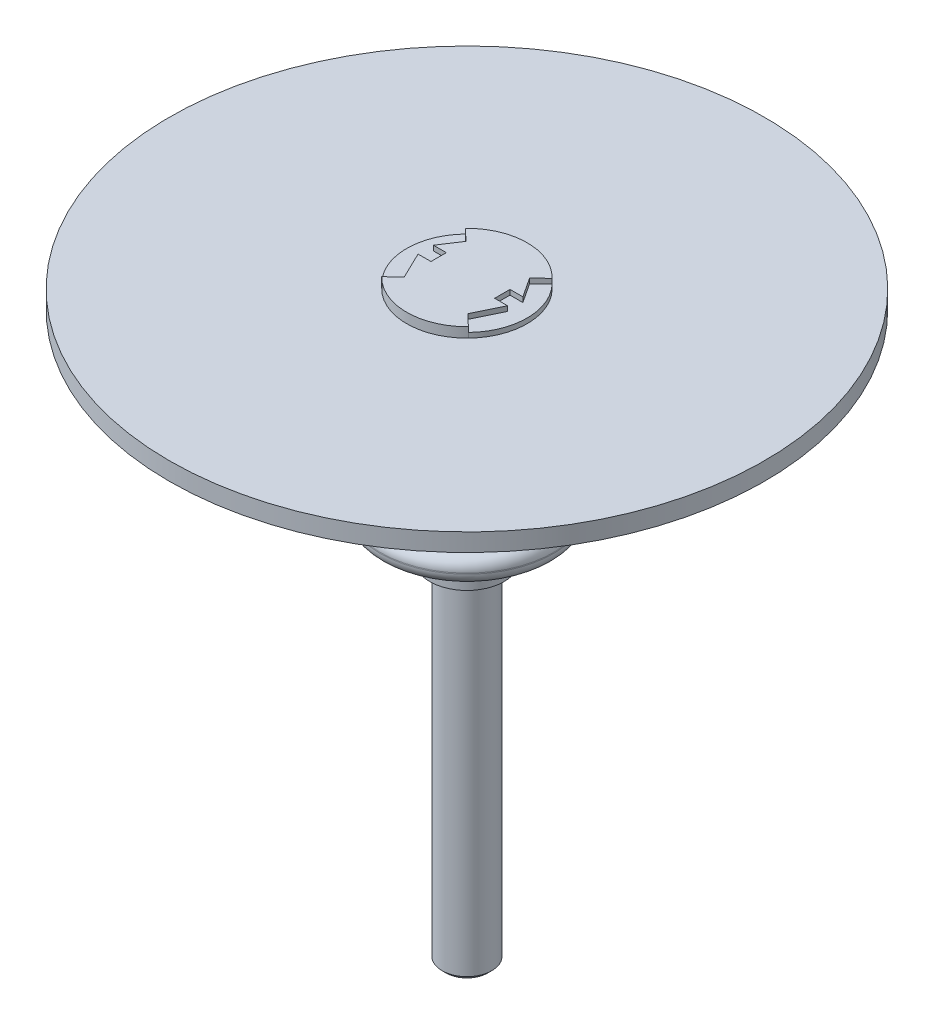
ISO-10303-21;
HEADER;
FILE_DESCRIPTION(('STEP AP214'),'2;1');
FILE_NAME('part.step','',(''),(''),'','','');
FILE_SCHEMA(('AUTOMOTIVE_DESIGN { 1 0 10303 214 1 1 1 1 }'));
ENDSEC;
DATA;
#1=APPLICATION_CONTEXT('core data for automotive mechanical design processes');
#2=APPLICATION_PROTOCOL_DEFINITION('international standard','automotive_design',2000,#1);
#3=PRODUCT_CONTEXT('',#1,'mechanical');
#4=PRODUCT('Part','Part','',(#3));
#5=PRODUCT_RELATED_PRODUCT_CATEGORY('part','',(#4));
#6=PRODUCT_DEFINITION_FORMATION('','',#4);
#7=PRODUCT_DEFINITION_CONTEXT('part definition',#1,'design');
#8=PRODUCT_DEFINITION('design','',#6,#7);
#9=PRODUCT_DEFINITION_SHAPE('','',#8);
#10=(LENGTH_UNIT() NAMED_UNIT(*) SI_UNIT(.MILLI.,.METRE.));
#11=(NAMED_UNIT(*) PLANE_ANGLE_UNIT() SI_UNIT($,.RADIAN.));
#12=(NAMED_UNIT(*) SI_UNIT($,.STERADIAN.) SOLID_ANGLE_UNIT());
#13=UNCERTAINTY_MEASURE_WITH_UNIT(LENGTH_MEASURE(1.E-05),#10,'distance_accuracy_value','');
#14=(GEOMETRIC_REPRESENTATION_CONTEXT(3) GLOBAL_UNCERTAINTY_ASSIGNED_CONTEXT((#13)) GLOBAL_UNIT_ASSIGNED_CONTEXT((#10,
#11,#12)) REPRESENTATION_CONTEXT('',''));
#15=CARTESIAN_POINT('',(0.,0.,0.));
#16=DIRECTION('',(0.,0.,1.));
#17=DIRECTION('',(1.,0.,0.));
#18=AXIS2_PLACEMENT_3D('',#15,#16,#17);
#19=CARTESIAN_POINT('',(0.,37.893625,0.));
#20=DIRECTION('',(0.,-1.,0.));
#21=DIRECTION('',(0.,0.,-1.));
#22=AXIS2_PLACEMENT_3D('',#19,#20,#21);
#23=CYLINDRICAL_SURFACE('',#22,3.85762499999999);
#24=CARTESIAN_POINT('',(0.,37.258625,0.));
#25=DIRECTION('',(0.,1.,0.));
#26=DIRECTION('',(0.,0.,1.));
#27=AXIS2_PLACEMENT_3D('',#24,#25,#26);
#28=CIRCLE('',#27,3.85762499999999);
#29=CARTESIAN_POINT('',(-2.77221887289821,37.258625,2.68254975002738));
#30=VERTEX_POINT('',#29);
#31=CARTESIAN_POINT('',(2.77221887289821,37.258625,2.68254975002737));
#32=VERTEX_POINT('',#31);
#33=EDGE_CURVE('E192',#30,#32,#28,.T.);
#34=ORIENTED_EDGE('',*,*,#33,.T.);
#35=DIRECTION('',(0.,-1.,0.));
#36=VECTOR('',#35,1.);
#37=CARTESIAN_POINT('',(2.77221887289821,37.893625,2.68254975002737));
#38=LINE('',#37,#36);
#39=CARTESIAN_POINT('',(2.77221887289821,37.893625,2.68254975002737));
#40=VERTEX_POINT('',#39);
#41=EDGE_CURVE('E12',#40,#32,#38,.T.);
#42=ORIENTED_EDGE('',*,*,#41,.F.);
#43=CARTESIAN_POINT('',(0.,37.893625,0.));
#44=DIRECTION('',(0.,1.,0.));
#45=DIRECTION('',(0.,0.,1.));
#46=AXIS2_PLACEMENT_3D('',#43,#44,#45);
#47=CIRCLE('',#46,3.85762499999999);
#48=CARTESIAN_POINT('',(-2.77221887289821,37.893625,2.68254975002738));
#49=VERTEX_POINT('',#48);
#50=EDGE_CURVE('E222',#49,#40,#47,.T.);
#51=ORIENTED_EDGE('',*,*,#50,.F.);
#52=DIRECTION('',(0.,-1.,0.));
#53=VECTOR('',#52,1.);
#54=CARTESIAN_POINT('',(-2.77221887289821,37.893625,2.68254975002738));
#55=LINE('',#54,#53);
#56=EDGE_CURVE('E188',#49,#30,#55,.T.);
#57=ORIENTED_EDGE('',*,*,#56,.T.);
#58=EDGE_LOOP('',(#34,#42,#51,#57));
#59=FACE_BOUND('',#58,.T.);
#60=ADVANCED_FACE('F48',(#59),#23,.T.);
#61=CARTESIAN_POINT('',(2.77221887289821,37.893625,2.68254975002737));
#62=DIRECTION('',(-0.695388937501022,0.,0.718633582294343));
#63=DIRECTION('',(0.718633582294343,0.,0.695388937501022));
#64=AXIS2_PLACEMENT_3D('',#61,#62,#63);
#65=PLANE('',#64);
#66=DIRECTION('',(-0.718633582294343,0.,-0.695388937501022));
#67=VECTOR('',#66,1.);
#68=CARTESIAN_POINT('',(2.77221887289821,37.258625,2.68254975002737));
#69=LINE('',#68,#67);
#70=CARTESIAN_POINT('',(2.03810067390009,37.258625,1.97217705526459));
#71=VERTEX_POINT('',#70);
#72=EDGE_CURVE('E195',#32,#71,#69,.T.);
#73=ORIENTED_EDGE('',*,*,#72,.T.);
#74=DIRECTION('',(0.,-1.,0.));
#75=VECTOR('',#74,1.);
#76=CARTESIAN_POINT('',(2.03810067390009,37.893625,1.97217705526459));
#77=LINE('',#76,#75);
#78=CARTESIAN_POINT('',(2.03810067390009,37.893625,1.97217705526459));
#79=VERTEX_POINT('',#78);
#80=EDGE_CURVE('E56',#79,#71,#77,.T.);
#81=ORIENTED_EDGE('',*,*,#80,.F.);
#82=DIRECTION('',(-0.718633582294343,0.,-0.695388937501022));
#83=VECTOR('',#82,1.);
#84=CARTESIAN_POINT('',(2.77221887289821,37.893625,2.68254975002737));
#85=LINE('',#84,#83);
#86=EDGE_CURVE('E131',#40,#79,#85,.T.);
#87=ORIENTED_EDGE('',*,*,#86,.F.);
#88=ORIENTED_EDGE('',*,*,#41,.T.);
#89=EDGE_LOOP('',(#73,#81,#87,#88));
#90=FACE_BOUND('',#89,.T.);
#91=ADVANCED_FACE('F320',(#90),#65,.F.);
#92=CARTESIAN_POINT('',(2.03810067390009,37.893625,1.97217705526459));
#93=DIRECTION('',(-0.900426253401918,0.,-0.435008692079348));
#94=DIRECTION('',(-0.435008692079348,0.,0.900426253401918));
#95=AXIS2_PLACEMENT_3D('',#92,#93,#94);
#96=PLANE('',#95);
#97=DIRECTION('',(0.435008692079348,0.,-0.900426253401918));
#98=VECTOR('',#97,1.);
#99=CARTESIAN_POINT('',(2.03810067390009,37.258625,1.97217705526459));
#100=LINE('',#99,#98);
#101=CARTESIAN_POINT('',(2.86273383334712,37.258625,0.265265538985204));
#102=VERTEX_POINT('',#101);
#103=EDGE_CURVE('E197',#71,#102,#100,.T.);
#104=ORIENTED_EDGE('',*,*,#103,.T.);
#105=DIRECTION('',(0.,-1.,0.));
#106=VECTOR('',#105,1.);
#107=CARTESIAN_POINT('',(2.86273383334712,37.893625,0.265265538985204));
#108=LINE('',#107,#106);
#109=CARTESIAN_POINT('',(2.86273383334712,37.893625,0.265265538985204));
#110=VERTEX_POINT('',#109);
#111=EDGE_CURVE('E253',#110,#102,#108,.T.);
#112=ORIENTED_EDGE('',*,*,#111,.F.);
#113=DIRECTION('',(0.435008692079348,0.,-0.900426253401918));
#114=VECTOR('',#113,1.);
#115=CARTESIAN_POINT('',(2.03810067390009,37.893625,1.97217705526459));
#116=LINE('',#115,#114);
#117=EDGE_CURVE('E261',#79,#110,#116,.T.);
#118=ORIENTED_EDGE('',*,*,#117,.F.);
#119=ORIENTED_EDGE('',*,*,#80,.T.);
#120=EDGE_LOOP('',(#104,#112,#118,#119));
#121=FACE_BOUND('',#120,.T.);
#122=ADVANCED_FACE('F259',(#121),#96,.F.);
#123=CARTESIAN_POINT('',(2.86273383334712,37.893625,0.265265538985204));
#124=DIRECTION('',(0.,0.,1.));
#125=DIRECTION('',(1.,0.,0.));
#126=AXIS2_PLACEMENT_3D('',#123,#124,#125);
#127=PLANE('',#126);
#128=DIRECTION('',(-1.,0.,0.));
#129=VECTOR('',#128,1.);
#130=CARTESIAN_POINT('',(2.86273383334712,37.258625,0.265265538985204));
#131=LINE('',#130,#129);
#132=CARTESIAN_POINT('',(2.03810067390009,37.258625,0.265265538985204));
#133=VERTEX_POINT('',#132);
#134=EDGE_CURVE('E199',#102,#133,#131,.T.);
#135=ORIENTED_EDGE('',*,*,#134,.T.);
#136=DIRECTION('',(0.,-1.,0.));
#137=VECTOR('',#136,1.);
#138=CARTESIAN_POINT('',(2.03810067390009,37.893625,0.265265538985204));
#139=LINE('',#138,#137);
#140=CARTESIAN_POINT('',(2.03810067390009,37.893625,0.265265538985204));
#141=VERTEX_POINT('',#140);
#142=EDGE_CURVE('E250',#141,#133,#139,.T.);
#143=ORIENTED_EDGE('',*,*,#142,.F.);
#144=DIRECTION('',(-1.,0.,0.));
#145=VECTOR('',#144,1.);
#146=CARTESIAN_POINT('',(2.86273383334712,37.893625,0.265265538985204));
#147=LINE('',#146,#145);
#148=EDGE_CURVE('E279',#110,#141,#147,.T.);
#149=ORIENTED_EDGE('',*,*,#148,.F.);
#150=ORIENTED_EDGE('',*,*,#111,.T.);
#151=EDGE_LOOP('',(#135,#143,#149,#150));
#152=FACE_BOUND('',#151,.T.);
#153=ADVANCED_FACE('F270',(#152),#127,.F.);
#154=CARTESIAN_POINT('',(2.03810067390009,37.893625,0.265265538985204));
#155=DIRECTION('',(-1.,0.,0.));
#156=DIRECTION('',(0.,0.,1.));
#157=AXIS2_PLACEMENT_3D('',#154,#155,#156);
#158=PLANE('',#157);
#159=DIRECTION('',(0.,0.,-1.));
#160=VECTOR('',#159,1.);
#161=CARTESIAN_POINT('',(2.03810067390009,37.258625,0.265265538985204));
#162=LINE('',#161,#160);
#163=CARTESIAN_POINT('',(2.03810067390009,37.258625,-0.718813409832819));
#164=VERTEX_POINT('',#163);
#165=EDGE_CURVE('E201',#133,#164,#162,.T.);
#166=ORIENTED_EDGE('',*,*,#165,.T.);
#167=DIRECTION('',(0.,-1.,0.));
#168=VECTOR('',#167,1.);
#169=CARTESIAN_POINT('',(2.03810067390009,37.893625,-0.718813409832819));
#170=LINE('',#169,#168);
#171=CARTESIAN_POINT('',(2.03810067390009,37.893625,-0.718813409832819));
#172=VERTEX_POINT('',#171);
#173=EDGE_CURVE('E247',#172,#164,#170,.T.);
#174=ORIENTED_EDGE('',*,*,#173,.F.);
#175=DIRECTION('',(0.,0.,-1.));
#176=VECTOR('',#175,1.);
#177=CARTESIAN_POINT('',(2.03810067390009,37.893625,0.265265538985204));
#178=LINE('',#177,#176);
#179=EDGE_CURVE('E276',#141,#172,#178,.T.);
#180=ORIENTED_EDGE('',*,*,#179,.F.);
#181=ORIENTED_EDGE('',*,*,#142,.T.);
#182=EDGE_LOOP('',(#166,#174,#180,#181));
#183=FACE_BOUND('',#182,.T.);
#184=ADVANCED_FACE('F274',(#183),#158,.F.);
#185=CARTESIAN_POINT('',(2.03810067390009,37.893625,-0.718813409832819));
#186=DIRECTION('',(0.,0.,-1.));
#187=DIRECTION('',(-1.,0.,0.));
#188=AXIS2_PLACEMENT_3D('',#185,#186,#187);
#189=PLANE('',#188);
#190=DIRECTION('',(1.,0.,0.));
#191=VECTOR('',#190,1.);
#192=CARTESIAN_POINT('',(2.03810067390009,37.258625,-0.718813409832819));
#193=LINE('',#192,#191);
#194=CARTESIAN_POINT('',(2.86273383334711,37.258625,-0.718813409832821));
#195=VERTEX_POINT('',#194);
#196=EDGE_CURVE('E203',#164,#195,#193,.T.);
#197=ORIENTED_EDGE('',*,*,#196,.T.);
#198=DIRECTION('',(0.,-1.,0.));
#199=VECTOR('',#198,1.);
#200=CARTESIAN_POINT('',(2.86273383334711,37.893625,-0.718813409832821));
#201=LINE('',#200,#199);
#202=CARTESIAN_POINT('',(2.86273383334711,37.893625,-0.718813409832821));
#203=VERTEX_POINT('',#202);
#204=EDGE_CURVE('E244',#203,#195,#201,.T.);
#205=ORIENTED_EDGE('',*,*,#204,.F.);
#206=DIRECTION('',(1.,0.,0.));
#207=VECTOR('',#206,1.);
#208=CARTESIAN_POINT('',(2.03810067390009,37.893625,-0.718813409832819));
#209=LINE('',#208,#207);
#210=EDGE_CURVE('E278',#172,#203,#209,.T.);
#211=ORIENTED_EDGE('',*,*,#210,.F.);
#212=ORIENTED_EDGE('',*,*,#173,.T.);
#213=EDGE_LOOP('',(#197,#205,#211,#212));
#214=FACE_BOUND('',#213,.T.);
#215=ADVANCED_FACE('F333',(#214),#189,.F.);
#216=CARTESIAN_POINT('',(2.86273383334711,37.893625,-0.718813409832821));
#217=DIRECTION('',(-0.835401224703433,0.,0.549640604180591));
#218=DIRECTION('',(0.549640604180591,0.,0.835401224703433));
#219=AXIS2_PLACEMENT_3D('',#216,#217,#218);
#220=PLANE('',#219);
#221=DIRECTION('',(-0.549640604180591,0.,-0.835401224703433));
#222=VECTOR('',#221,1.);
#223=CARTESIAN_POINT('',(2.86273383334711,37.258625,-0.718813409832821));
#224=LINE('',#223,#222);
#225=CARTESIAN_POINT('',(2.03810067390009,37.258625,-1.97217705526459));
#226=VERTEX_POINT('',#225);
#227=EDGE_CURVE('E205',#195,#226,#224,.T.);
#228=ORIENTED_EDGE('',*,*,#227,.T.);
#229=DIRECTION('',(0.,-1.,0.));
#230=VECTOR('',#229,1.);
#231=CARTESIAN_POINT('',(2.03810067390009,37.893625,-1.97217705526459));
#232=LINE('',#231,#230);
#233=CARTESIAN_POINT('',(2.03810067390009,37.893625,-1.97217705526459));
#234=VERTEX_POINT('',#233);
#235=EDGE_CURVE('E241',#234,#226,#232,.T.);
#236=ORIENTED_EDGE('',*,*,#235,.F.);
#237=DIRECTION('',(-0.549640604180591,0.,-0.835401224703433));
#238=VECTOR('',#237,1.);
#239=CARTESIAN_POINT('',(2.86273383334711,37.893625,-0.718813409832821));
#240=LINE('',#239,#238);
#241=EDGE_CURVE('E281',#203,#234,#240,.T.);
#242=ORIENTED_EDGE('',*,*,#241,.F.);
#243=ORIENTED_EDGE('',*,*,#204,.T.);
#244=EDGE_LOOP('',(#228,#236,#242,#243));
#245=FACE_BOUND('',#244,.T.);
#246=ADVANCED_FACE('F336',(#245),#220,.F.);
#247=CARTESIAN_POINT('',(2.03810067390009,37.893625,-1.97217705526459));
#248=DIRECTION('',(-0.695388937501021,0.,-0.718633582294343));
#249=DIRECTION('',(-0.718633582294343,0.,0.695388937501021));
#250=AXIS2_PLACEMENT_3D('',#247,#248,#249);
#251=PLANE('',#250);
#252=DIRECTION('',(0.718633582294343,0.,-0.695388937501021));
#253=VECTOR('',#252,1.);
#254=CARTESIAN_POINT('',(2.03810067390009,37.258625,-1.97217705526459));
#255=LINE('',#254,#253);
#256=CARTESIAN_POINT('',(2.77221887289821,37.258625,-2.68254975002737));
#257=VERTEX_POINT('',#256);
#258=EDGE_CURVE('E207',#226,#257,#255,.T.);
#259=ORIENTED_EDGE('',*,*,#258,.T.);
#260=DIRECTION('',(0.,-1.,0.));
#261=VECTOR('',#260,1.);
#262=CARTESIAN_POINT('',(2.77221887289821,37.893625,-2.68254975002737));
#263=LINE('',#262,#261);
#264=CARTESIAN_POINT('',(2.77221887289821,37.893625,-2.68254975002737));
#265=VERTEX_POINT('',#264);
#266=EDGE_CURVE('E238',#265,#257,#263,.T.);
#267=ORIENTED_EDGE('',*,*,#266,.F.);
#268=DIRECTION('',(0.718633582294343,0.,-0.695388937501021));
#269=VECTOR('',#268,1.);
#270=CARTESIAN_POINT('',(2.03810067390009,37.893625,-1.97217705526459));
#271=LINE('',#270,#269);
#272=EDGE_CURVE('E287',#234,#265,#271,.T.);
#273=ORIENTED_EDGE('',*,*,#272,.F.);
#274=ORIENTED_EDGE('',*,*,#235,.T.);
#275=EDGE_LOOP('',(#259,#267,#273,#274));
#276=FACE_BOUND('',#275,.T.);
#277=ADVANCED_FACE('F340',(#276),#251,.F.);
#278=CARTESIAN_POINT('',(0.,37.893625,0.));
#279=DIRECTION('',(0.,-1.,0.));
#280=DIRECTION('',(0.,0.,-1.));
#281=AXIS2_PLACEMENT_3D('',#278,#279,#280);
#282=CYLINDRICAL_SURFACE('',#281,3.85762499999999);
#283=CARTESIAN_POINT('',(0.,37.258625,0.));
#284=DIRECTION('',(0.,1.,0.));
#285=DIRECTION('',(0.,0.,-1.));
#286=AXIS2_PLACEMENT_3D('',#283,#284,#285);
#287=CIRCLE('',#286,3.85762499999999);
#288=CARTESIAN_POINT('',(-2.77221887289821,37.258625,-2.68254975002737));
#289=VERTEX_POINT('',#288);
#290=EDGE_CURVE('E209',#257,#289,#287,.T.);
#291=ORIENTED_EDGE('',*,*,#290,.T.);
#292=DIRECTION('',(0.,-1.,0.));
#293=VECTOR('',#292,1.);
#294=CARTESIAN_POINT('',(-2.77221887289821,37.893625,-2.68254975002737));
#295=LINE('',#294,#293);
#296=CARTESIAN_POINT('',(-2.77221887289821,37.893625,-2.68254975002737));
#297=VERTEX_POINT('',#296);
#298=EDGE_CURVE('E235',#297,#289,#295,.T.);
#299=ORIENTED_EDGE('',*,*,#298,.F.);
#300=CARTESIAN_POINT('',(0.,37.893625,0.));
#301=DIRECTION('',(0.,1.,0.));
#302=DIRECTION('',(0.,0.,-1.));
#303=AXIS2_PLACEMENT_3D('',#300,#301,#302);
#304=CIRCLE('',#303,3.85762499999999);
#305=EDGE_CURVE('E289',#265,#297,#304,.T.);
#306=ORIENTED_EDGE('',*,*,#305,.F.);
#307=ORIENTED_EDGE('',*,*,#266,.T.);
#308=EDGE_LOOP('',(#291,#299,#306,#307));
#309=FACE_BOUND('',#308,.T.);
#310=ADVANCED_FACE('F344',(#309),#282,.T.);
#311=CARTESIAN_POINT('',(-2.03810067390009,37.893625,-1.97217705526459));
#312=DIRECTION('',(0.695388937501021,0.,-0.718633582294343));
#313=DIRECTION('',(-0.718633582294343,0.,-0.695388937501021));
#314=AXIS2_PLACEMENT_3D('',#311,#312,#313);
#315=PLANE('',#314);
#316=DIRECTION('',(0.718633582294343,0.,0.695388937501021));
#317=VECTOR('',#316,1.);
#318=CARTESIAN_POINT('',(-2.03810067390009,37.258625,-1.97217705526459));
#319=LINE('',#318,#317);
#320=CARTESIAN_POINT('',(-2.03810067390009,37.258625,-1.97217705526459));
#321=VERTEX_POINT('',#320);
#322=EDGE_CURVE('E211',#289,#321,#319,.T.);
#323=ORIENTED_EDGE('',*,*,#322,.T.);
#324=DIRECTION('',(0.,-1.,0.));
#325=VECTOR('',#324,1.);
#326=CARTESIAN_POINT('',(-2.03810067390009,37.893625,-1.97217705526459));
#327=LINE('',#326,#325);
#328=CARTESIAN_POINT('',(-2.03810067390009,37.893625,-1.97217705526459));
#329=VERTEX_POINT('',#328);
#330=EDGE_CURVE('E232',#329,#321,#327,.T.);
#331=ORIENTED_EDGE('',*,*,#330,.F.);
#332=DIRECTION('',(0.718633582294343,0.,0.695388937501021));
#333=VECTOR('',#332,1.);
#334=CARTESIAN_POINT('',(-2.03810067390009,37.893625,-1.97217705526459));
#335=LINE('',#334,#333);
#336=EDGE_CURVE('E291',#297,#329,#335,.T.);
#337=ORIENTED_EDGE('',*,*,#336,.F.);
#338=ORIENTED_EDGE('',*,*,#298,.T.);
#339=EDGE_LOOP('',(#323,#331,#337,#338));
#340=FACE_BOUND('',#339,.T.);
#341=ADVANCED_FACE('F348',(#340),#315,.F.);
#342=CARTESIAN_POINT('',(-2.86273383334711,37.893625,-0.718813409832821));
#343=DIRECTION('',(0.835401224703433,0.,0.54964060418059));
#344=DIRECTION('',(0.54964060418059,0.,-0.835401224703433));
#345=AXIS2_PLACEMENT_3D('',#342,#343,#344);
#346=PLANE('',#345);
#347=DIRECTION('',(-0.54964060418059,0.,0.835401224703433));
#348=VECTOR('',#347,1.);
#349=CARTESIAN_POINT('',(-2.86273383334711,37.258625,-0.718813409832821));
#350=LINE('',#349,#348);
#351=CARTESIAN_POINT('',(-2.86273383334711,37.258625,-0.718813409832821));
#352=VERTEX_POINT('',#351);
#353=EDGE_CURVE('E213',#321,#352,#350,.T.);
#354=ORIENTED_EDGE('',*,*,#353,.T.);
#355=DIRECTION('',(0.,-1.,0.));
#356=VECTOR('',#355,1.);
#357=CARTESIAN_POINT('',(-2.86273383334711,37.893625,-0.718813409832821));
#358=LINE('',#357,#356);
#359=CARTESIAN_POINT('',(-2.86273383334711,37.893625,-0.718813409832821));
#360=VERTEX_POINT('',#359);
#361=EDGE_CURVE('E229',#360,#352,#358,.T.);
#362=ORIENTED_EDGE('',*,*,#361,.F.);
#363=DIRECTION('',(-0.54964060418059,0.,0.835401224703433));
#364=VECTOR('',#363,1.);
#365=CARTESIAN_POINT('',(-2.86273383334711,37.893625,-0.718813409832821));
#366=LINE('',#365,#364);
#367=EDGE_CURVE('E293',#329,#360,#366,.T.);
#368=ORIENTED_EDGE('',*,*,#367,.F.);
#369=ORIENTED_EDGE('',*,*,#330,.T.);
#370=EDGE_LOOP('',(#354,#362,#368,#369));
#371=FACE_BOUND('',#370,.T.);
#372=ADVANCED_FACE('F352',(#371),#346,.F.);
#373=CARTESIAN_POINT('',(-2.03810067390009,37.893625,-0.718813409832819));
#374=DIRECTION('',(0.,0.,-1.));
#375=DIRECTION('',(-1.,0.,0.));
#376=AXIS2_PLACEMENT_3D('',#373,#374,#375);
#377=PLANE('',#376);
#378=DIRECTION('',(1.,0.,0.));
#379=VECTOR('',#378,1.);
#380=CARTESIAN_POINT('',(-2.03810067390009,37.258625,-0.718813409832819));
#381=LINE('',#380,#379);
#382=CARTESIAN_POINT('',(-2.03810067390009,37.258625,-0.718813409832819));
#383=VERTEX_POINT('',#382);
#384=EDGE_CURVE('E215',#352,#383,#381,.T.);
#385=ORIENTED_EDGE('',*,*,#384,.T.);
#386=DIRECTION('',(0.,-1.,0.));
#387=VECTOR('',#386,1.);
#388=CARTESIAN_POINT('',(-2.03810067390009,37.893625,-0.718813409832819));
#389=LINE('',#388,#387);
#390=CARTESIAN_POINT('',(-2.03810067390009,37.893625,-0.718813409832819));
#391=VERTEX_POINT('',#390);
#392=EDGE_CURVE('E226',#391,#383,#389,.T.);
#393=ORIENTED_EDGE('',*,*,#392,.F.);
#394=DIRECTION('',(1.,0.,0.));
#395=VECTOR('',#394,1.);
#396=CARTESIAN_POINT('',(-2.03810067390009,37.893625,-0.718813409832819));
#397=LINE('',#396,#395);
#398=EDGE_CURVE('E295',#360,#391,#397,.T.);
#399=ORIENTED_EDGE('',*,*,#398,.F.);
#400=ORIENTED_EDGE('',*,*,#361,.T.);
#401=EDGE_LOOP('',(#385,#393,#399,#400));
#402=FACE_BOUND('',#401,.T.);
#403=ADVANCED_FACE('F301',(#402),#377,.F.);
#404=CARTESIAN_POINT('',(-2.03810067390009,37.893625,0.265265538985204));
#405=DIRECTION('',(1.,0.,0.));
#406=DIRECTION('',(0.,0.,-1.));
#407=AXIS2_PLACEMENT_3D('',#404,#405,#406);
#408=PLANE('',#407);
#409=DIRECTION('',(0.,0.,1.));
#410=VECTOR('',#409,1.);
#411=CARTESIAN_POINT('',(-2.03810067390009,37.258625,0.265265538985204));
#412=LINE('',#411,#410);
#413=CARTESIAN_POINT('',(-2.03810067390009,37.258625,0.265265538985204));
#414=VERTEX_POINT('',#413);
#415=EDGE_CURVE('E217',#383,#414,#412,.T.);
#416=ORIENTED_EDGE('',*,*,#415,.T.);
#417=DIRECTION('',(0.,-1.,0.));
#418=VECTOR('',#417,1.);
#419=CARTESIAN_POINT('',(-2.03810067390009,37.893625,0.265265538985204));
#420=LINE('',#419,#418);
#421=CARTESIAN_POINT('',(-2.03810067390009,37.893625,0.265265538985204));
#422=VERTEX_POINT('',#421);
#423=EDGE_CURVE('E183',#422,#414,#420,.T.);
#424=ORIENTED_EDGE('',*,*,#423,.F.);
#425=DIRECTION('',(0.,0.,1.));
#426=VECTOR('',#425,1.);
#427=CARTESIAN_POINT('',(-2.03810067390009,37.893625,0.265265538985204));
#428=LINE('',#427,#426);
#429=EDGE_CURVE('E174',#391,#422,#428,.T.);
#430=ORIENTED_EDGE('',*,*,#429,.F.);
#431=ORIENTED_EDGE('',*,*,#392,.T.);
#432=EDGE_LOOP('',(#416,#424,#430,#431));
#433=FACE_BOUND('',#432,.T.);
#434=ADVANCED_FACE('F305',(#433),#408,.F.);
#435=CARTESIAN_POINT('',(-2.86273383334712,37.893625,0.265265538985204));
#436=DIRECTION('',(0.,0.,1.));
#437=DIRECTION('',(1.,0.,0.));
#438=AXIS2_PLACEMENT_3D('',#435,#436,#437);
#439=PLANE('',#438);
#440=DIRECTION('',(-1.,0.,0.));
#441=VECTOR('',#440,1.);
#442=CARTESIAN_POINT('',(-2.86273383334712,37.258625,0.265265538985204));
#443=LINE('',#442,#441);
#444=CARTESIAN_POINT('',(-2.86273383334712,37.258625,0.265265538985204));
#445=VERTEX_POINT('',#444);
#446=EDGE_CURVE('E182',#414,#445,#443,.T.);
#447=ORIENTED_EDGE('',*,*,#446,.T.);
#448=DIRECTION('',(0.,-1.,0.));
#449=VECTOR('',#448,1.);
#450=CARTESIAN_POINT('',(-2.86273383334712,37.893625,0.265265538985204));
#451=LINE('',#450,#449);
#452=CARTESIAN_POINT('',(-2.86273383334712,37.893625,0.265265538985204));
#453=VERTEX_POINT('',#452);
#454=EDGE_CURVE('E179',#453,#445,#451,.T.);
#455=ORIENTED_EDGE('',*,*,#454,.F.);
#456=DIRECTION('',(-1.,0.,0.));
#457=VECTOR('',#456,1.);
#458=CARTESIAN_POINT('',(-2.86273383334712,37.893625,0.265265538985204));
#459=LINE('',#458,#457);
#460=EDGE_CURVE('E168',#422,#453,#459,.T.);
#461=ORIENTED_EDGE('',*,*,#460,.F.);
#462=ORIENTED_EDGE('',*,*,#423,.T.);
#463=EDGE_LOOP('',(#447,#455,#461,#462));
#464=FACE_BOUND('',#463,.T.);
#465=ADVANCED_FACE('F180',(#464),#439,.F.);
#466=CARTESIAN_POINT('',(-2.03810067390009,37.893625,1.97217705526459));
#467=DIRECTION('',(0.900426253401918,0.,-0.435008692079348));
#468=DIRECTION('',(-0.435008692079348,0.,-0.900426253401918));
#469=AXIS2_PLACEMENT_3D('',#466,#467,#468);
#470=PLANE('',#469);
#471=DIRECTION('',(0.435008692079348,0.,0.900426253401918));
#472=VECTOR('',#471,1.);
#473=CARTESIAN_POINT('',(-2.03810067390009,37.258625,1.97217705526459));
#474=LINE('',#473,#472);
#475=CARTESIAN_POINT('',(-2.03810067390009,37.258625,1.97217705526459));
#476=VERTEX_POINT('',#475);
#477=EDGE_CURVE('E117',#445,#476,#474,.T.);
#478=ORIENTED_EDGE('',*,*,#477,.T.);
#479=DIRECTION('',(0.,-1.,0.));
#480=VECTOR('',#479,1.);
#481=CARTESIAN_POINT('',(-2.03810067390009,37.893625,1.97217705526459));
#482=LINE('',#481,#480);
#483=CARTESIAN_POINT('',(-2.03810067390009,37.893625,1.97217705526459));
#484=VERTEX_POINT('',#483);
#485=EDGE_CURVE('E184',#484,#476,#482,.T.);
#486=ORIENTED_EDGE('',*,*,#485,.F.);
#487=DIRECTION('',(0.435008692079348,0.,0.900426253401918));
#488=VECTOR('',#487,1.);
#489=CARTESIAN_POINT('',(-2.03810067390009,37.893625,1.97217705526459));
#490=LINE('',#489,#488);
#491=EDGE_CURVE('E172',#453,#484,#490,.T.);
#492=ORIENTED_EDGE('',*,*,#491,.F.);
#493=ORIENTED_EDGE('',*,*,#454,.T.);
#494=EDGE_LOOP('',(#478,#486,#492,#493));
#495=FACE_BOUND('',#494,.T.);
#496=ADVANCED_FACE('F186',(#495),#470,.F.);
#497=CARTESIAN_POINT('',(-2.77221887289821,37.893625,2.68254975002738));
#498=DIRECTION('',(0.695388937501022,0.,0.718633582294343));
#499=DIRECTION('',(0.718633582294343,0.,-0.695388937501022));
#500=AXIS2_PLACEMENT_3D('',#497,#498,#499);
#501=PLANE('',#500);
#502=DIRECTION('',(-0.718633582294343,0.,0.695388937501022));
#503=VECTOR('',#502,1.);
#504=CARTESIAN_POINT('',(-2.77221887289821,37.258625,2.68254975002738));
#505=LINE('',#504,#503);
#506=EDGE_CURVE('E123',#476,#30,#505,.T.);
#507=ORIENTED_EDGE('',*,*,#506,.T.);
#508=ORIENTED_EDGE('',*,*,#56,.F.);
#509=DIRECTION('',(-0.718633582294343,0.,0.695388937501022));
#510=VECTOR('',#509,1.);
#511=CARTESIAN_POINT('',(-2.77221887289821,37.893625,2.68254975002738));
#512=LINE('',#511,#510);
#513=EDGE_CURVE('E64',#484,#49,#512,.T.);
#514=ORIENTED_EDGE('',*,*,#513,.F.);
#515=ORIENTED_EDGE('',*,*,#485,.T.);
#516=EDGE_LOOP('',(#507,#508,#514,#515));
#517=FACE_BOUND('',#516,.T.);
#518=ADVANCED_FACE('F309',(#517),#501,.F.);
#519=CARTESIAN_POINT('',(0.,37.893625,0.));
#520=DIRECTION('',(0.,1.,0.));
#521=DIRECTION('',(0.,0.,1.));
#522=AXIS2_PLACEMENT_3D('',#519,#520,#521);
#523=PLANE('',#522);
#524=ORIENTED_EDGE('',*,*,#50,.T.);
#525=ORIENTED_EDGE('',*,*,#86,.T.);
#526=ORIENTED_EDGE('',*,*,#117,.T.);
#527=ORIENTED_EDGE('',*,*,#148,.T.);
#528=ORIENTED_EDGE('',*,*,#179,.T.);
#529=ORIENTED_EDGE('',*,*,#210,.T.);
#530=ORIENTED_EDGE('',*,*,#241,.T.);
#531=ORIENTED_EDGE('',*,*,#272,.T.);
#532=ORIENTED_EDGE('',*,*,#305,.T.);
#533=ORIENTED_EDGE('',*,*,#336,.T.);
#534=ORIENTED_EDGE('',*,*,#367,.T.);
#535=ORIENTED_EDGE('',*,*,#398,.T.);
#536=ORIENTED_EDGE('',*,*,#429,.T.);
#537=ORIENTED_EDGE('',*,*,#460,.T.);
#538=ORIENTED_EDGE('',*,*,#491,.T.);
#539=ORIENTED_EDGE('',*,*,#513,.T.);
#540=EDGE_LOOP('',(#524,#525,#526,#527,#528,#529,#530,#531,#532,#533,#534,#535,#536,#537,#538,#539));
#541=FACE_BOUND('',#540,.T.);
#542=ADVANCED_FACE('F170',(#541),#523,.T.);
#543=CARTESIAN_POINT('',(0.,37.258625,0.));
#544=DIRECTION('',(0.,1.,0.));
#545=DIRECTION('',(0.,0.,1.));
#546=AXIS2_PLACEMENT_3D('',#543,#544,#545);
#547=PLANE('',#546);
#548=ORIENTED_EDGE('',*,*,#33,.F.);
#549=ORIENTED_EDGE('',*,*,#506,.F.);
#550=ORIENTED_EDGE('',*,*,#477,.F.);
#551=ORIENTED_EDGE('',*,*,#446,.F.);
#552=ORIENTED_EDGE('',*,*,#415,.F.);
#553=ORIENTED_EDGE('',*,*,#384,.F.);
#554=ORIENTED_EDGE('',*,*,#353,.F.);
#555=ORIENTED_EDGE('',*,*,#322,.F.);
#556=ORIENTED_EDGE('',*,*,#290,.F.);
#557=ORIENTED_EDGE('',*,*,#258,.F.);
#558=ORIENTED_EDGE('',*,*,#227,.F.);
#559=ORIENTED_EDGE('',*,*,#196,.F.);
#560=ORIENTED_EDGE('',*,*,#165,.F.);
#561=ORIENTED_EDGE('',*,*,#134,.F.);
#562=ORIENTED_EDGE('',*,*,#103,.F.);
#563=ORIENTED_EDGE('',*,*,#72,.F.);
#564=EDGE_LOOP('',(#548,#549,#550,#551,#552,#553,#554,#555,#556,#557,#558,#559,#560,#561,#562,#563));
#565=FACE_BOUND('',#564,.T.);
#566=ADVANCED_FACE('F265',(#565),#547,.F.);
#567=CLOSED_SHELL('',(#60,#91,#122,#153,#184,#215,#246,#277,#310,#341,#372,#403,#434,#465,#496,
#518,#542,#566));
#568=MANIFOLD_SOLID_BREP('B2',#567);
#569=CARTESIAN_POINT('',(0.,37.576125,0.));
#570=DIRECTION('',(-0.695388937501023,0.,0.718633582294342));
#571=DIRECTION('',(0.718633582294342,0.,0.695388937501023));
#572=AXIS2_PLACEMENT_3D('',#569,#570,#571);
#573=PLANE('',#572);
#574=DIRECTION('',(-0.718633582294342,0.,-0.695388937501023));
#575=VECTOR('',#574,1.);
#576=CARTESIAN_POINT('',(0.,37.258625,0.));
#577=LINE('',#576,#575);
#578=CARTESIAN_POINT('',(2.77221887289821,37.258625,2.68254975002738));
#579=VERTEX_POINT('',#578);
#580=CARTESIAN_POINT('',(2.03810067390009,37.258625,1.97217705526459));
#581=VERTEX_POINT('',#580);
#582=EDGE_CURVE('E587',#579,#581,#577,.T.);
#583=ORIENTED_EDGE('',*,*,#582,.F.);
#584=DIRECTION('',(0.,-1.,0.));
#585=VECTOR('',#584,1.);
#586=CARTESIAN_POINT('',(2.77221887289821,37.576125,2.68254975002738));
#587=LINE('',#586,#585);
#588=CARTESIAN_POINT('',(2.77221887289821,37.576125,2.68254975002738));
#589=VERTEX_POINT('',#588);
#590=EDGE_CURVE('E46',#589,#579,#587,.T.);
#591=ORIENTED_EDGE('',*,*,#590,.F.);
#592=DIRECTION('',(-0.718633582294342,0.,-0.695388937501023));
#593=VECTOR('',#592,1.);
#594=CARTESIAN_POINT('',(0.,37.576125,0.));
#595=LINE('',#594,#593);
#596=CARTESIAN_POINT('',(2.03810067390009,37.576125,1.97217705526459));
#597=VERTEX_POINT('',#596);
#598=EDGE_CURVE('E602',#589,#597,#595,.T.);
#599=ORIENTED_EDGE('',*,*,#598,.T.);
#600=DIRECTION('',(0.,-1.,0.));
#601=VECTOR('',#600,1.);
#602=CARTESIAN_POINT('',(2.03810067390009,37.576125,1.97217705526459));
#603=LINE('',#602,#601);
#604=EDGE_CURVE('E545',#597,#581,#603,.T.);
#605=ORIENTED_EDGE('',*,*,#604,.T.);
#606=EDGE_LOOP('',(#583,#591,#599,#605));
#607=FACE_BOUND('',#606,.T.);
#608=ADVANCED_FACE('F494',(#607),#573,.T.);
#609=CARTESIAN_POINT('',(0.,37.576125,0.));
#610=DIRECTION('',(0.,-1.,0.));
#611=DIRECTION('',(0.,0.,-1.));
#612=AXIS2_PLACEMENT_3D('',#609,#610,#611);
#613=CYLINDRICAL_SURFACE('',#612,3.85762499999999);
#614=CARTESIAN_POINT('',(0.,37.258625,0.));
#615=DIRECTION('',(0.,1.,0.));
#616=DIRECTION('',(0.,0.,1.));
#617=AXIS2_PLACEMENT_3D('',#614,#615,#616);
#618=CIRCLE('',#617,3.85762499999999);
#619=CARTESIAN_POINT('',(2.77221887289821,37.258625,-2.68254975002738));
#620=VERTEX_POINT('',#619);
#621=EDGE_CURVE('E590',#579,#620,#618,.T.);
#622=ORIENTED_EDGE('',*,*,#621,.T.);
#623=DIRECTION('',(0.,-1.,0.));
#624=VECTOR('',#623,1.);
#625=CARTESIAN_POINT('',(2.77221887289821,37.576125,-2.68254975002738));
#626=LINE('',#625,#624);
#627=CARTESIAN_POINT('',(2.77221887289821,37.576125,-2.68254975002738));
#628=VERTEX_POINT('',#627);
#629=EDGE_CURVE('E502',#628,#620,#626,.T.);
#630=ORIENTED_EDGE('',*,*,#629,.F.);
#631=CARTESIAN_POINT('',(0.,37.576125,0.));
#632=DIRECTION('',(0.,1.,0.));
#633=DIRECTION('',(0.,0.,1.));
#634=AXIS2_PLACEMENT_3D('',#631,#632,#633);
#635=CIRCLE('',#634,3.85762499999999);
#636=EDGE_CURVE('E635',#589,#628,#635,.T.);
#637=ORIENTED_EDGE('',*,*,#636,.F.);
#638=ORIENTED_EDGE('',*,*,#590,.T.);
#639=EDGE_LOOP('',(#622,#630,#637,#638));
#640=FACE_BOUND('',#639,.T.);
#641=ADVANCED_FACE('F637',(#640),#613,.T.);
#642=CARTESIAN_POINT('',(0.,37.576125,0.));
#643=DIRECTION('',(0.695388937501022,0.,0.718633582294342));
#644=DIRECTION('',(0.718633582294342,0.,-0.695388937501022));
#645=AXIS2_PLACEMENT_3D('',#642,#643,#644);
#646=PLANE('',#645);
#647=DIRECTION('',(-0.718633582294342,0.,0.695388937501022));
#648=VECTOR('',#647,1.);
#649=CARTESIAN_POINT('',(0.,37.258625,0.));
#650=LINE('',#649,#648);
#651=CARTESIAN_POINT('',(2.03810067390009,37.258625,-1.97217705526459));
#652=VERTEX_POINT('',#651);
#653=EDGE_CURVE('E592',#620,#652,#650,.T.);
#654=ORIENTED_EDGE('',*,*,#653,.T.);
#655=DIRECTION('',(0.,-1.,0.));
#656=VECTOR('',#655,1.);
#657=CARTESIAN_POINT('',(2.03810067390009,37.576125,-1.97217705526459));
#658=LINE('',#657,#656);
#659=CARTESIAN_POINT('',(2.03810067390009,37.576125,-1.97217705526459));
#660=VERTEX_POINT('',#659);
#661=EDGE_CURVE('E609',#660,#652,#658,.T.);
#662=ORIENTED_EDGE('',*,*,#661,.F.);
#663=DIRECTION('',(-0.718633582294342,0.,0.695388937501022));
#664=VECTOR('',#663,1.);
#665=CARTESIAN_POINT('',(0.,37.576125,0.));
#666=LINE('',#665,#664);
#667=EDGE_CURVE('E618',#628,#660,#666,.T.);
#668=ORIENTED_EDGE('',*,*,#667,.F.);
#669=ORIENTED_EDGE('',*,*,#629,.T.);
#670=EDGE_LOOP('',(#654,#662,#668,#669));
#671=FACE_BOUND('',#670,.T.);
#672=ADVANCED_FACE('F616',(#671),#646,.F.);
#673=CARTESIAN_POINT('',(2.32794608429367,37.576125,-1.53163971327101));
#674=DIRECTION('',(0.835401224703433,0.,-0.54964060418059));
#675=DIRECTION('',(-0.54964060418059,0.,-0.835401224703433));
#676=AXIS2_PLACEMENT_3D('',#673,#674,#675);
#677=PLANE('',#676);
#678=DIRECTION('',(0.54964060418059,0.,0.835401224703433));
#679=VECTOR('',#678,1.);
#680=CARTESIAN_POINT('',(2.32794608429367,37.258625,-1.53163971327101));
#681=LINE('',#680,#679);
#682=CARTESIAN_POINT('',(2.86273383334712,37.258625,-0.718813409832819));
#683=VERTEX_POINT('',#682);
#684=EDGE_CURVE('E594',#652,#683,#681,.T.);
#685=ORIENTED_EDGE('',*,*,#684,.T.);
#686=DIRECTION('',(0.,-1.,0.));
#687=VECTOR('',#686,1.);
#688=CARTESIAN_POINT('',(2.86273383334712,37.576125,-0.718813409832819));
#689=LINE('',#688,#687);
#690=CARTESIAN_POINT('',(2.86273383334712,37.576125,-0.718813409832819));
#691=VERTEX_POINT('',#690);
#692=EDGE_CURVE('E606',#691,#683,#689,.T.);
#693=ORIENTED_EDGE('',*,*,#692,.F.);
#694=DIRECTION('',(0.54964060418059,0.,0.835401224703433));
#695=VECTOR('',#694,1.);
#696=CARTESIAN_POINT('',(2.32794608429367,37.576125,-1.53163971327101));
#697=LINE('',#696,#695);
#698=EDGE_CURVE('E631',#660,#691,#697,.T.);
#699=ORIENTED_EDGE('',*,*,#698,.F.);
#700=ORIENTED_EDGE('',*,*,#661,.T.);
#701=EDGE_LOOP('',(#685,#693,#699,#700));
#702=FACE_BOUND('',#701,.T.);
#703=ADVANCED_FACE('F627',(#702),#677,.F.);
#704=CARTESIAN_POINT('',(0.,37.576125,-0.718813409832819));
#705=DIRECTION('',(0.,0.,1.));
#706=DIRECTION('',(1.,0.,0.));
#707=AXIS2_PLACEMENT_3D('',#704,#705,#706);
#708=PLANE('',#707);
#709=DIRECTION('',(-1.,0.,0.));
#710=VECTOR('',#709,1.);
#711=CARTESIAN_POINT('',(0.,37.258625,-0.718813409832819));
#712=LINE('',#711,#710);
#713=CARTESIAN_POINT('',(2.03810067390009,37.258625,-0.718813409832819));
#714=VERTEX_POINT('',#713);
#715=EDGE_CURVE('E596',#683,#714,#712,.T.);
#716=ORIENTED_EDGE('',*,*,#715,.T.);
#717=DIRECTION('',(0.,-1.,0.));
#718=VECTOR('',#717,1.);
#719=CARTESIAN_POINT('',(2.03810067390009,37.576125,-0.718813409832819));
#720=LINE('',#719,#718);
#721=CARTESIAN_POINT('',(2.03810067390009,37.576125,-0.718813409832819));
#722=VERTEX_POINT('',#721);
#723=EDGE_CURVE('E579',#722,#714,#720,.T.);
#724=ORIENTED_EDGE('',*,*,#723,.F.);
#725=DIRECTION('',(-1.,0.,0.));
#726=VECTOR('',#725,1.);
#727=CARTESIAN_POINT('',(0.,37.576125,-0.718813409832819));
#728=LINE('',#727,#726);
#729=EDGE_CURVE('E570',#691,#722,#728,.T.);
#730=ORIENTED_EDGE('',*,*,#729,.F.);
#731=ORIENTED_EDGE('',*,*,#692,.T.);
#732=EDGE_LOOP('',(#716,#724,#730,#731));
#733=FACE_BOUND('',#732,.T.);
#734=ADVANCED_FACE('F630',(#733),#708,.F.);
#735=CARTESIAN_POINT('',(2.03810067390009,37.576125,0.));
#736=DIRECTION('',(1.,0.,0.));
#737=DIRECTION('',(0.,0.,-1.));
#738=AXIS2_PLACEMENT_3D('',#735,#736,#737);
#739=PLANE('',#738);
#740=DIRECTION('',(0.,0.,1.));
#741=VECTOR('',#740,1.);
#742=CARTESIAN_POINT('',(2.03810067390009,37.258625,0.));
#743=LINE('',#742,#741);
#744=CARTESIAN_POINT('',(2.03810067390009,37.258625,0.265265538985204));
#745=VERTEX_POINT('',#744);
#746=EDGE_CURVE('E578',#714,#745,#743,.T.);
#747=ORIENTED_EDGE('',*,*,#746,.T.);
#748=DIRECTION('',(0.,-1.,0.));
#749=VECTOR('',#748,1.);
#750=CARTESIAN_POINT('',(2.03810067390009,37.576125,0.265265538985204));
#751=LINE('',#750,#749);
#752=CARTESIAN_POINT('',(2.03810067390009,37.576125,0.265265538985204));
#753=VERTEX_POINT('',#752);
#754=EDGE_CURVE('E575',#753,#745,#751,.T.);
#755=ORIENTED_EDGE('',*,*,#754,.F.);
#756=DIRECTION('',(0.,0.,1.));
#757=VECTOR('',#756,1.);
#758=CARTESIAN_POINT('',(2.03810067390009,37.576125,0.));
#759=LINE('',#758,#757);
#760=EDGE_CURVE('E564',#722,#753,#759,.T.);
#761=ORIENTED_EDGE('',*,*,#760,.F.);
#762=ORIENTED_EDGE('',*,*,#723,.T.);
#763=EDGE_LOOP('',(#747,#755,#761,#762));
#764=FACE_BOUND('',#763,.T.);
#765=ADVANCED_FACE('F576',(#764),#739,.F.);
#766=CARTESIAN_POINT('',(0.,37.576125,0.265265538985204));
#767=DIRECTION('',(0.,0.,-1.));
#768=DIRECTION('',(-1.,0.,0.));
#769=AXIS2_PLACEMENT_3D('',#766,#767,#768);
#770=PLANE('',#769);
#771=DIRECTION('',(1.,0.,0.));
#772=VECTOR('',#771,1.);
#773=CARTESIAN_POINT('',(0.,37.258625,0.265265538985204));
#774=LINE('',#773,#772);
#775=CARTESIAN_POINT('',(2.86273383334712,37.258625,0.265265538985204));
#776=VERTEX_POINT('',#775);
#777=EDGE_CURVE('E538',#745,#776,#774,.T.);
#778=ORIENTED_EDGE('',*,*,#777,.T.);
#779=DIRECTION('',(0.,-1.,0.));
#780=VECTOR('',#779,1.);
#781=CARTESIAN_POINT('',(2.86273383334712,37.576125,0.265265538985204));
#782=LINE('',#781,#780);
#783=CARTESIAN_POINT('',(2.86273383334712,37.576125,0.265265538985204));
#784=VERTEX_POINT('',#783);
#785=EDGE_CURVE('E580',#784,#776,#782,.T.);
#786=ORIENTED_EDGE('',*,*,#785,.F.);
#787=DIRECTION('',(1.,0.,0.));
#788=VECTOR('',#787,1.);
#789=CARTESIAN_POINT('',(0.,37.576125,0.265265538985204));
#790=LINE('',#789,#788);
#791=EDGE_CURVE('E568',#753,#784,#790,.T.);
#792=ORIENTED_EDGE('',*,*,#791,.F.);
#793=ORIENTED_EDGE('',*,*,#754,.T.);
#794=EDGE_LOOP('',(#778,#786,#792,#793));
#795=FACE_BOUND('',#794,.T.);
#796=ADVANCED_FACE('F582',(#795),#770,.F.);
#797=CARTESIAN_POINT('',(2.42491409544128,37.576125,1.17151038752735));
#798=DIRECTION('',(0.900426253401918,0.,0.435008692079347));
#799=DIRECTION('',(0.435008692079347,0.,-0.900426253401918));
#800=AXIS2_PLACEMENT_3D('',#797,#798,#799);
#801=PLANE('',#800);
#802=DIRECTION('',(-0.435008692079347,0.,0.900426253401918));
#803=VECTOR('',#802,1.);
#804=CARTESIAN_POINT('',(2.42491409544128,37.258625,1.17151038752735));
#805=LINE('',#804,#803);
#806=EDGE_CURVE('E600',#776,#581,#805,.T.);
#807=ORIENTED_EDGE('',*,*,#806,.T.);
#808=ORIENTED_EDGE('',*,*,#604,.F.);
#809=DIRECTION('',(-0.435008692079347,0.,0.900426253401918));
#810=VECTOR('',#809,1.);
#811=CARTESIAN_POINT('',(2.42491409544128,37.576125,1.17151038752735));
#812=LINE('',#811,#810);
#813=EDGE_CURVE('E510',#784,#597,#812,.T.);
#814=ORIENTED_EDGE('',*,*,#813,.F.);
#815=ORIENTED_EDGE('',*,*,#785,.T.);
#816=EDGE_LOOP('',(#807,#808,#814,#815));
#817=FACE_BOUND('',#816,.T.);
#818=ADVANCED_FACE('F653',(#817),#801,.F.);
#819=CARTESIAN_POINT('',(0.,37.576125,0.));
#820=DIRECTION('',(0.,1.,0.));
#821=DIRECTION('',(0.,0.,1.));
#822=AXIS2_PLACEMENT_3D('',#819,#820,#821);
#823=PLANE('',#822);
#824=ORIENTED_EDGE('',*,*,#598,.F.);
#825=ORIENTED_EDGE('',*,*,#636,.T.);
#826=ORIENTED_EDGE('',*,*,#667,.T.);
#827=ORIENTED_EDGE('',*,*,#698,.T.);
#828=ORIENTED_EDGE('',*,*,#729,.T.);
#829=ORIENTED_EDGE('',*,*,#760,.T.);
#830=ORIENTED_EDGE('',*,*,#791,.T.);
#831=ORIENTED_EDGE('',*,*,#813,.T.);
#832=EDGE_LOOP('',(#824,#825,#826,#827,#828,#829,#830,#831));
#833=FACE_BOUND('',#832,.T.);
#834=ADVANCED_FACE('F566',(#833),#823,.T.);
#835=CARTESIAN_POINT('',(0.,37.258625,0.));
#836=DIRECTION('',(0.,1.,0.));
#837=DIRECTION('',(0.,0.,1.));
#838=AXIS2_PLACEMENT_3D('',#835,#836,#837);
#839=PLANE('',#838);
#840=ORIENTED_EDGE('',*,*,#582,.T.);
#841=ORIENTED_EDGE('',*,*,#806,.F.);
#842=ORIENTED_EDGE('',*,*,#777,.F.);
#843=ORIENTED_EDGE('',*,*,#746,.F.);
#844=ORIENTED_EDGE('',*,*,#715,.F.);
#845=ORIENTED_EDGE('',*,*,#684,.F.);
#846=ORIENTED_EDGE('',*,*,#653,.F.);
#847=ORIENTED_EDGE('',*,*,#621,.F.);
#848=EDGE_LOOP('',(#840,#841,#842,#843,#844,#845,#846,#847));
#849=FACE_BOUND('',#848,.T.);
#850=ADVANCED_FACE('F623',(#849),#839,.F.);
#851=CLOSED_SHELL('',(#608,#641,#672,#703,#734,#765,#796,#818,#834,#850));
#852=MANIFOLD_SOLID_BREP('B6',#851);
#853=CARTESIAN_POINT('',(0.,37.576125,0.));
#854=DIRECTION('',(0.695388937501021,0.,-0.718633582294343));
#855=DIRECTION('',(-0.718633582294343,0.,-0.695388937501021));
#856=AXIS2_PLACEMENT_3D('',#853,#854,#855);
#857=PLANE('',#856);
#858=DIRECTION('',(0.718633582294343,0.,0.695388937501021));
#859=VECTOR('',#858,1.);
#860=CARTESIAN_POINT('',(0.,37.258625,0.));
#861=LINE('',#860,#859);
#862=CARTESIAN_POINT('',(-2.77221887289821,37.258625,-2.68254975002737));
#863=VERTEX_POINT('',#862);
#864=CARTESIAN_POINT('',(-2.03810067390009,37.258625,-1.97217705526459));
#865=VERTEX_POINT('',#864);
#866=EDGE_CURVE('E824',#863,#865,#861,.T.);
#867=ORIENTED_EDGE('',*,*,#866,.F.);
#868=DIRECTION('',(0.,-1.,0.));
#869=VECTOR('',#868,1.);
#870=CARTESIAN_POINT('',(-2.77221887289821,37.576125,-2.68254975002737));
#871=LINE('',#870,#869);
#872=CARTESIAN_POINT('',(-2.77221887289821,37.576125,-2.68254975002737));
#873=VERTEX_POINT('',#872);
#874=EDGE_CURVE('E492',#873,#863,#871,.T.);
#875=ORIENTED_EDGE('',*,*,#874,.F.);
#876=DIRECTION('',(0.718633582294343,0.,0.695388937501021));
#877=VECTOR('',#876,1.);
#878=CARTESIAN_POINT('',(0.,37.576125,0.));
#879=LINE('',#878,#877);
#880=CARTESIAN_POINT('',(-2.03810067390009,37.576125,-1.97217705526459));
#881=VERTEX_POINT('',#880);
#882=EDGE_CURVE('E843',#873,#881,#879,.T.);
#883=ORIENTED_EDGE('',*,*,#882,.T.);
#884=DIRECTION('',(0.,-1.,0.));
#885=VECTOR('',#884,1.);
#886=CARTESIAN_POINT('',(-2.03810067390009,37.576125,-1.97217705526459));
#887=LINE('',#886,#885);
#888=EDGE_CURVE('E746',#881,#865,#887,.T.);
#889=ORIENTED_EDGE('',*,*,#888,.T.);
#890=EDGE_LOOP('',(#867,#875,#883,#889));
#891=FACE_BOUND('',#890,.T.);
#892=ADVANCED_FACE('F730',(#891),#857,.T.);
#893=CARTESIAN_POINT('',(0.,37.576125,0.));
#894=DIRECTION('',(0.,-1.,0.));
#895=DIRECTION('',(0.,0.,-1.));
#896=AXIS2_PLACEMENT_3D('',#893,#894,#895);
#897=CYLINDRICAL_SURFACE('',#896,3.85762499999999);
#898=CARTESIAN_POINT('',(0.,37.258625,0.));
#899=DIRECTION('',(0.,1.,0.));
#900=DIRECTION('',(0.,0.,1.));
#901=AXIS2_PLACEMENT_3D('',#898,#899,#900);
#902=CIRCLE('',#901,3.85762499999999);
#903=CARTESIAN_POINT('',(-2.77221887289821,37.258625,2.68254975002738));
#904=VERTEX_POINT('',#903);
#905=EDGE_CURVE('E826',#863,#904,#902,.T.);
#906=ORIENTED_EDGE('',*,*,#905,.T.);
#907=DIRECTION('',(0.,-1.,0.));
#908=VECTOR('',#907,1.);
#909=CARTESIAN_POINT('',(-2.77221887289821,37.576125,2.68254975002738));
#910=LINE('',#909,#908);
#911=CARTESIAN_POINT('',(-2.77221887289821,37.576125,2.68254975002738));
#912=VERTEX_POINT('',#911);
#913=EDGE_CURVE('E738',#912,#904,#910,.T.);
#914=ORIENTED_EDGE('',*,*,#913,.F.);
#915=CARTESIAN_POINT('',(0.,37.576125,0.));
#916=DIRECTION('',(0.,1.,0.));
#917=DIRECTION('',(0.,0.,1.));
#918=AXIS2_PLACEMENT_3D('',#915,#916,#917);
#919=CIRCLE('',#918,3.85762499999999);
#920=EDGE_CURVE('E869',#873,#912,#919,.T.);
#921=ORIENTED_EDGE('',*,*,#920,.F.);
#922=ORIENTED_EDGE('',*,*,#874,.T.);
#923=EDGE_LOOP('',(#906,#914,#921,#922));
#924=FACE_BOUND('',#923,.T.);
#925=ADVANCED_FACE('F884',(#924),#897,.T.);
#926=CARTESIAN_POINT('',(0.,37.576125,0.));
#927=DIRECTION('',(-0.695388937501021,0.,-0.718633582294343));
#928=DIRECTION('',(-0.718633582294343,0.,0.695388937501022));
#929=AXIS2_PLACEMENT_3D('',#926,#927,#928);
#930=PLANE('',#929);
#931=DIRECTION('',(0.718633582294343,0.,-0.695388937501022));
#932=VECTOR('',#931,1.);
#933=CARTESIAN_POINT('',(0.,37.258625,0.));
#934=LINE('',#933,#932);
#935=CARTESIAN_POINT('',(-2.03810067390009,37.258625,1.97217705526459));
#936=VERTEX_POINT('',#935);
#937=EDGE_CURVE('E828',#904,#936,#934,.T.);
#938=ORIENTED_EDGE('',*,*,#937,.T.);
#939=DIRECTION('',(0.,-1.,0.));
#940=VECTOR('',#939,1.);
#941=CARTESIAN_POINT('',(-2.03810067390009,37.576125,1.97217705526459));
#942=LINE('',#941,#940);
#943=CARTESIAN_POINT('',(-2.03810067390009,37.576125,1.97217705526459));
#944=VERTEX_POINT('',#943);
#945=EDGE_CURVE('E849',#944,#936,#942,.T.);
#946=ORIENTED_EDGE('',*,*,#945,.F.);
#947=DIRECTION('',(0.718633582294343,0.,-0.695388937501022));
#948=VECTOR('',#947,1.);
#949=CARTESIAN_POINT('',(0.,37.576125,0.));
#950=LINE('',#949,#948);
#951=EDGE_CURVE('E857',#912,#944,#950,.T.);
#952=ORIENTED_EDGE('',*,*,#951,.F.);
#953=ORIENTED_EDGE('',*,*,#913,.T.);
#954=EDGE_LOOP('',(#938,#946,#952,#953));
#955=FACE_BOUND('',#954,.T.);
#956=ADVANCED_FACE('F855',(#955),#930,.F.);
#957=CARTESIAN_POINT('',(-2.42491409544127,37.576125,1.17151038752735));
#958=DIRECTION('',(0.900426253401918,0.,-0.435008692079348));
#959=DIRECTION('',(-0.435008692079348,0.,-0.900426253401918));
#960=AXIS2_PLACEMENT_3D('',#957,#958,#959);
#961=PLANE('',#960);
#962=DIRECTION('',(0.435008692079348,0.,0.900426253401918));
#963=VECTOR('',#962,1.);
#964=CARTESIAN_POINT('',(-2.42491409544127,37.258625,1.17151038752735));
#965=LINE('',#964,#963);
#966=CARTESIAN_POINT('',(-2.86273383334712,37.258625,0.265265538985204));
#967=VERTEX_POINT('',#966);
#968=EDGE_CURVE('E831',#967,#936,#965,.T.);
#969=ORIENTED_EDGE('',*,*,#968,.F.);
#970=DIRECTION('',(0.,-1.,0.));
#971=VECTOR('',#970,1.);
#972=CARTESIAN_POINT('',(-2.86273383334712,37.576125,0.265265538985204));
#973=LINE('',#972,#971);
#974=CARTESIAN_POINT('',(-2.86273383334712,37.576125,0.265265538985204));
#975=VERTEX_POINT('',#974);
#976=EDGE_CURVE('E847',#975,#967,#973,.T.);
#977=ORIENTED_EDGE('',*,*,#976,.F.);
#978=DIRECTION('',(0.435008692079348,0.,0.900426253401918));
#979=VECTOR('',#978,1.);
#980=CARTESIAN_POINT('',(-2.42491409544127,37.576125,1.17151038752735));
#981=LINE('',#980,#979);
#982=EDGE_CURVE('E867',#975,#944,#981,.T.);
#983=ORIENTED_EDGE('',*,*,#982,.T.);
#984=ORIENTED_EDGE('',*,*,#945,.T.);
#985=EDGE_LOOP('',(#969,#977,#983,#984));
#986=FACE_BOUND('',#985,.T.);
#987=ADVANCED_FACE('F865',(#986),#961,.T.);
#988=CARTESIAN_POINT('',(0.,37.576125,0.265265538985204));
#989=DIRECTION('',(0.,0.,1.));
#990=DIRECTION('',(1.,0.,0.));
#991=AXIS2_PLACEMENT_3D('',#988,#989,#990);
#992=PLANE('',#991);
#993=DIRECTION('',(-1.,0.,0.));
#994=VECTOR('',#993,1.);
#995=CARTESIAN_POINT('',(0.,37.258625,0.265265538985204));
#996=LINE('',#995,#994);
#997=CARTESIAN_POINT('',(-2.03810067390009,37.258625,0.265265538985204));
#998=VERTEX_POINT('',#997);
#999=EDGE_CURVE('E834',#998,#967,#996,.T.);
#1000=ORIENTED_EDGE('',*,*,#999,.F.);
#1001=DIRECTION('',(0.,-1.,0.));
#1002=VECTOR('',#1001,1.);
#1003=CARTESIAN_POINT('',(-2.03810067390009,37.576125,0.265265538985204));
#1004=LINE('',#1003,#1002);
#1005=CARTESIAN_POINT('',(-2.03810067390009,37.576125,0.265265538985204));
#1006=VERTEX_POINT('',#1005);
#1007=EDGE_CURVE('E805',#1006,#998,#1004,.T.);
#1008=ORIENTED_EDGE('',*,*,#1007,.F.);
#1009=DIRECTION('',(-1.,0.,0.));
#1010=VECTOR('',#1009,1.);
#1011=CARTESIAN_POINT('',(0.,37.576125,0.265265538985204));
#1012=LINE('',#1011,#1010);
#1013=EDGE_CURVE('E816',#1006,#975,#1012,.T.);
#1014=ORIENTED_EDGE('',*,*,#1013,.T.);
#1015=ORIENTED_EDGE('',*,*,#976,.T.);
#1016=EDGE_LOOP('',(#1000,#1008,#1014,#1015));
#1017=FACE_BOUND('',#1016,.T.);
#1018=ADVANCED_FACE('F895',(#1017),#992,.T.);
#1019=CARTESIAN_POINT('',(-2.03810067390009,37.576125,0.));
#1020=DIRECTION('',(1.,0.,0.));
#1021=DIRECTION('',(0.,0.,-1.));
#1022=AXIS2_PLACEMENT_3D('',#1019,#1020,#1021);
#1023=PLANE('',#1022);
#1024=DIRECTION('',(0.,0.,1.));
#1025=VECTOR('',#1024,1.);
#1026=CARTESIAN_POINT('',(-2.03810067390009,37.258625,0.));
#1027=LINE('',#1026,#1025);
#1028=CARTESIAN_POINT('',(-2.03810067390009,37.258625,-0.718813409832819));
#1029=VERTEX_POINT('',#1028);
#1030=EDGE_CURVE('E801',#1029,#998,#1027,.T.);
#1031=ORIENTED_EDGE('',*,*,#1030,.F.);
#1032=DIRECTION('',(0.,-1.,0.));
#1033=VECTOR('',#1032,1.);
#1034=CARTESIAN_POINT('',(-2.03810067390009,37.576125,-0.718813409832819));
#1035=LINE('',#1034,#1033);
#1036=CARTESIAN_POINT('',(-2.03810067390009,37.576125,-0.718813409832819));
#1037=VERTEX_POINT('',#1036);
#1038=EDGE_CURVE('E796',#1037,#1029,#1035,.T.);
#1039=ORIENTED_EDGE('',*,*,#1038,.F.);
#1040=DIRECTION('',(0.,0.,1.));
#1041=VECTOR('',#1040,1.);
#1042=CARTESIAN_POINT('',(-2.03810067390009,37.576125,0.));
#1043=LINE('',#1042,#1041);
#1044=EDGE_CURVE('E799',#1037,#1006,#1043,.T.);
#1045=ORIENTED_EDGE('',*,*,#1044,.T.);
#1046=ORIENTED_EDGE('',*,*,#1007,.T.);
#1047=EDGE_LOOP('',(#1031,#1039,#1045,#1046));
#1048=FACE_BOUND('',#1047,.T.);
#1049=ADVANCED_FACE('F798',(#1048),#1023,.T.);
#1050=CARTESIAN_POINT('',(0.,37.576125,-0.718813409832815));
#1051=DIRECTION('',(0.,0.,-1.));
#1052=DIRECTION('',(-1.,0.,0.));
#1053=AXIS2_PLACEMENT_3D('',#1050,#1051,#1052);
#1054=PLANE('',#1053);
#1055=DIRECTION('',(1.,0.,0.));
#1056=VECTOR('',#1055,1.);
#1057=CARTESIAN_POINT('',(0.,37.258625,-0.718813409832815));
#1058=LINE('',#1057,#1056);
#1059=CARTESIAN_POINT('',(-2.86273383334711,37.258625,-0.718813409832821));
#1060=VERTEX_POINT('',#1059);
#1061=EDGE_CURVE('E838',#1060,#1029,#1058,.T.);
#1062=ORIENTED_EDGE('',*,*,#1061,.F.);
#1063=DIRECTION('',(0.,-1.,0.));
#1064=VECTOR('',#1063,1.);
#1065=CARTESIAN_POINT('',(-2.86273383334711,37.576125,-0.718813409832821));
#1066=LINE('',#1065,#1064);
#1067=CARTESIAN_POINT('',(-2.86273383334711,37.576125,-0.718813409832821));
#1068=VERTEX_POINT('',#1067);
#1069=EDGE_CURVE('E771',#1068,#1060,#1066,.T.);
#1070=ORIENTED_EDGE('',*,*,#1069,.F.);
#1071=DIRECTION('',(1.,0.,0.));
#1072=VECTOR('',#1071,1.);
#1073=CARTESIAN_POINT('',(0.,37.576125,-0.718813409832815));
#1074=LINE('',#1073,#1072);
#1075=EDGE_CURVE('E813',#1068,#1037,#1074,.T.);
#1076=ORIENTED_EDGE('',*,*,#1075,.T.);
#1077=ORIENTED_EDGE('',*,*,#1038,.T.);
#1078=EDGE_LOOP('',(#1062,#1070,#1076,#1077));
#1079=FACE_BOUND('',#1078,.T.);
#1080=ADVANCED_FACE('F818',(#1079),#1054,.T.);
#1081=CARTESIAN_POINT('',(-2.32794608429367,37.576125,-1.531639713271));
#1082=DIRECTION('',(0.835401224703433,0.,0.54964060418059));
#1083=DIRECTION('',(0.54964060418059,0.,-0.835401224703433));
#1084=AXIS2_PLACEMENT_3D('',#1081,#1082,#1083);
#1085=PLANE('',#1084);
#1086=DIRECTION('',(-0.54964060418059,0.,0.835401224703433));
#1087=VECTOR('',#1086,1.);
#1088=CARTESIAN_POINT('',(-2.32794608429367,37.258625,-1.531639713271));
#1089=LINE('',#1088,#1087);
#1090=EDGE_CURVE('E840',#865,#1060,#1089,.T.);
#1091=ORIENTED_EDGE('',*,*,#1090,.F.);
#1092=ORIENTED_EDGE('',*,*,#888,.F.);
#1093=DIRECTION('',(-0.54964060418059,0.,0.835401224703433));
#1094=VECTOR('',#1093,1.);
#1095=CARTESIAN_POINT('',(-2.32794608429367,37.576125,-1.531639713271));
#1096=LINE('',#1095,#1094);
#1097=EDGE_CURVE('E819',#881,#1068,#1096,.T.);
#1098=ORIENTED_EDGE('',*,*,#1097,.T.);
#1099=ORIENTED_EDGE('',*,*,#1069,.T.);
#1100=EDGE_LOOP('',(#1091,#1092,#1098,#1099));
#1101=FACE_BOUND('',#1100,.T.);
#1102=ADVANCED_FACE('F873',(#1101),#1085,.T.);
#1103=CARTESIAN_POINT('',(0.,37.576125,0.));
#1104=DIRECTION('',(0.,1.,0.));
#1105=DIRECTION('',(0.,0.,1.));
#1106=AXIS2_PLACEMENT_3D('',#1103,#1104,#1105);
#1107=PLANE('',#1106);
#1108=ORIENTED_EDGE('',*,*,#882,.F.);
#1109=ORIENTED_EDGE('',*,*,#920,.T.);
#1110=ORIENTED_EDGE('',*,*,#951,.T.);
#1111=ORIENTED_EDGE('',*,*,#982,.F.);
#1112=ORIENTED_EDGE('',*,*,#1013,.F.);
#1113=ORIENTED_EDGE('',*,*,#1044,.F.);
#1114=ORIENTED_EDGE('',*,*,#1075,.F.);
#1115=ORIENTED_EDGE('',*,*,#1097,.F.);
#1116=EDGE_LOOP('',(#1108,#1109,#1110,#1111,#1112,#1113,#1114,#1115));
#1117=FACE_BOUND('',#1116,.T.);
#1118=ADVANCED_FACE('F811',(#1117),#1107,.T.);
#1119=CARTESIAN_POINT('',(0.,37.258625,0.));
#1120=DIRECTION('',(0.,1.,0.));
#1121=DIRECTION('',(0.,0.,1.));
#1122=AXIS2_PLACEMENT_3D('',#1119,#1120,#1121);
#1123=PLANE('',#1122);
#1124=ORIENTED_EDGE('',*,*,#866,.T.);
#1125=ORIENTED_EDGE('',*,*,#1090,.T.);
#1126=ORIENTED_EDGE('',*,*,#1061,.T.);
#1127=ORIENTED_EDGE('',*,*,#1030,.T.);
#1128=ORIENTED_EDGE('',*,*,#999,.T.);
#1129=ORIENTED_EDGE('',*,*,#968,.T.);
#1130=ORIENTED_EDGE('',*,*,#937,.F.);
#1131=ORIENTED_EDGE('',*,*,#905,.F.);
#1132=EDGE_LOOP('',(#1124,#1125,#1126,#1127,#1128,#1129,#1130,#1131));
#1133=FACE_BOUND('',#1132,.T.);
#1134=ADVANCED_FACE('F861',(#1133),#1123,.F.);
#1135=CLOSED_SHELL('',(#892,#925,#956,#987,#1018,#1049,#1080,#1102,#1118,#1134));
#1136=MANIFOLD_SOLID_BREP('B40',#1135);
#1137=CARTESIAN_POINT('',(0.,37.258625,0.));
#1138=DIRECTION('',(0.,-1.,0.));
#1139=DIRECTION('',(0.,0.,-1.));
#1140=AXIS2_PLACEMENT_3D('',#1137,#1138,#1139);
#1141=CYLINDRICAL_SURFACE('',#1140,19.05);
#1142=CARTESIAN_POINT('',(0.,37.258625,0.));
#1143=DIRECTION('',(0.,1.,0.));
#1144=DIRECTION('',(0.,0.,1.));
#1145=AXIS2_PLACEMENT_3D('',#1142,#1143,#1144);
#1146=CIRCLE('',#1145,19.05);
#1147=CARTESIAN_POINT('',(0.,37.258625,19.05));
#1148=VERTEX_POINT('',#1147);
#1149=EDGE_CURVE('E729',#1148,#1148,#1146,.T.);
#1150=ORIENTED_EDGE('',*,*,#1149,.F.);
#1151=EDGE_LOOP('',(#1150));
#1152=FACE_BOUND('',#1151,.T.);
#1153=CARTESIAN_POINT('',(0.,36.115625,0.));
#1154=DIRECTION('',(0.,1.,0.));
#1155=DIRECTION('',(0.,0.,1.));
#1156=AXIS2_PLACEMENT_3D('',#1153,#1154,#1155);
#1157=CIRCLE('',#1156,19.05);
#1158=CARTESIAN_POINT('',(0.,36.115625,19.05));
#1159=VERTEX_POINT('',#1158);
#1160=EDGE_CURVE('E969',#1159,#1159,#1157,.T.);
#1161=ORIENTED_EDGE('',*,*,#1160,.T.);
#1162=EDGE_LOOP('',(#1161));
#1163=FACE_BOUND('',#1162,.T.);
#1164=ADVANCED_FACE('F966',(#1152,#1163),#1141,.T.);
#1165=CARTESIAN_POINT('',(0.,37.258625,0.));
#1166=DIRECTION('',(0.,1.,0.));
#1167=DIRECTION('',(0.,0.,1.));
#1168=AXIS2_PLACEMENT_3D('',#1165,#1166,#1167);
#1169=PLANE('',#1168);
#1170=ORIENTED_EDGE('',*,*,#1149,.T.);
#1171=EDGE_LOOP('',(#1170));
#1172=FACE_BOUND('',#1171,.T.);
#1173=ADVANCED_FACE('F981',(#1172),#1169,.T.);
#1174=CARTESIAN_POINT('',(0.,36.115625,0.));
#1175=DIRECTION('',(0.,1.,0.));
#1176=DIRECTION('',(0.,0.,1.));
#1177=AXIS2_PLACEMENT_3D('',#1174,#1175,#1176);
#1178=PLANE('',#1177);
#1179=ORIENTED_EDGE('',*,*,#1160,.F.);
#1180=EDGE_LOOP('',(#1179));
#1181=FACE_BOUND('',#1180,.T.);
#1182=ADVANCED_FACE('F979',(#1181),#1178,.F.);
#1183=CLOSED_SHELL('',(#1164,#1173,#1182));
#1184=MANIFOLD_SOLID_BREP('B486',#1183);
#1185=CARTESIAN_POINT('',(0.,26.19375,0.));
#1186=DIRECTION('',(0.,1.,0.));
#1187=DIRECTION('',(0.,0.,1.));
#1188=AXIS2_PLACEMENT_3D('',#1185,#1186,#1187);
#1189=PLANE('',#1188);
#1190=CARTESIAN_POINT('',(0.,26.19375,0.));
#1191=DIRECTION('',(0.,1.,0.));
#1192=DIRECTION('',(0.,0.,1.));
#1193=AXIS2_PLACEMENT_3D('',#1190,#1191,#1192);
#1194=CIRCLE('',#1193,4.619625);
#1195=CARTESIAN_POINT('',(0.,26.19375,4.619625));
#1196=VERTEX_POINT('',#1195);
#1197=EDGE_CURVE('E1030',#1196,#1196,#1194,.F.);
#1198=ORIENTED_EDGE('',*,*,#1197,.T.);
#1199=EDGE_LOOP('',(#1198));
#1200=FACE_BOUND('',#1199,.T.);
#1201=CARTESIAN_POINT('',(0.,26.19375,0.));
#1202=DIRECTION('',(0.,1.,0.));
#1203=DIRECTION('',(0.,0.,1.));
#1204=AXIS2_PLACEMENT_3D('',#1201,#1202,#1203);
#1205=CIRCLE('',#1204,4.79425);
#1206=CARTESIAN_POINT('',(0.,26.19375,4.79425));
#1207=VERTEX_POINT('',#1206);
#1208=EDGE_CURVE('E1039',#1207,#1207,#1205,.T.);
#1209=ORIENTED_EDGE('',*,*,#1208,.T.);
#1210=EDGE_LOOP('',(#1209));
#1211=FACE_BOUND('',#1210,.T.);
#1212=ADVANCED_FACE('F1019',(#1200,#1211),#1189,.T.);
#1213=CARTESIAN_POINT('',(0.,26.19375,0.));
#1214=DIRECTION('',(0.,-1.,0.));
#1215=DIRECTION('',(0.,0.,-1.));
#1216=AXIS2_PLACEMENT_3D('',#1213,#1214,#1215);
#1217=CYLINDRICAL_SURFACE('',#1216,5.55625);
#1218=CARTESIAN_POINT('',(0.,25.36825,0.));
#1219=DIRECTION('',(0.,1.,0.));
#1220=DIRECTION('',(0.,0.,1.));
#1221=AXIS2_PLACEMENT_3D('',#1218,#1219,#1220);
#1222=CIRCLE('',#1221,5.55625);
#1223=CARTESIAN_POINT('',(0.,25.36825,5.55625));
#1224=VERTEX_POINT('',#1223);
#1225=EDGE_CURVE('E1042',#1224,#1224,#1222,.T.);
#1226=ORIENTED_EDGE('',*,*,#1225,.T.);
#1227=EDGE_LOOP('',(#1226));
#1228=FACE_BOUND('',#1227,.T.);
#1229=CARTESIAN_POINT('',(0.,25.43175,0.));
#1230=DIRECTION('',(0.,1.,0.));
#1231=DIRECTION('',(0.,0.,1.));
#1232=AXIS2_PLACEMENT_3D('',#1229,#1230,#1231);
#1233=CIRCLE('',#1232,5.55625);
#1234=CARTESIAN_POINT('',(0.,25.43175,5.55625));
#1235=VERTEX_POINT('',#1234);
#1236=EDGE_CURVE('E1045',#1235,#1235,#1233,.F.);
#1237=ORIENTED_EDGE('',*,*,#1236,.T.);
#1238=EDGE_LOOP('',(#1237));
#1239=FACE_BOUND('',#1238,.T.);
#1240=ADVANCED_FACE('F1088',(#1228,#1239),#1217,.T.);
#1241=CARTESIAN_POINT('',(0.,35.321875,0.));
#1242=DIRECTION('',(0.,-1.,0.));
#1243=DIRECTION('',(0.,0.,-1.));
#1244=AXIS2_PLACEMENT_3D('',#1241,#1242,#1243);
#1245=CYLINDRICAL_SURFACE('',#1244,4.365625);
#1246=CARTESIAN_POINT('',(0.,34.813875,0.));
#1247=DIRECTION('',(0.,1.,0.));
#1248=DIRECTION('',(0.,0.,1.));
#1249=AXIS2_PLACEMENT_3D('',#1246,#1247,#1248);
#1250=CIRCLE('',#1249,4.365625);
#1251=CARTESIAN_POINT('',(0.,34.813875,4.365625));
#1252=VERTEX_POINT('',#1251);
#1253=EDGE_CURVE('E965',#1252,#1252,#1250,.F.);
#1254=ORIENTED_EDGE('',*,*,#1253,.T.);
#1255=EDGE_LOOP('',(#1254));
#1256=FACE_BOUND('',#1255,.T.);
#1257=CARTESIAN_POINT('',(0.,26.44775,0.));
#1258=DIRECTION('',(0.,1.,0.));
#1259=DIRECTION('',(0.,0.,1.));
#1260=AXIS2_PLACEMENT_3D('',#1257,#1258,#1259);
#1261=CIRCLE('',#1260,4.365625);
#1262=CARTESIAN_POINT('',(0.,26.44775,4.365625));
#1263=VERTEX_POINT('',#1262);
#1264=EDGE_CURVE('E1034',#1263,#1263,#1261,.T.);
#1265=ORIENTED_EDGE('',*,*,#1264,.T.);
#1266=EDGE_LOOP('',(#1265));
#1267=FACE_BOUND('',#1266,.T.);
#1268=ADVANCED_FACE('F1084',(#1256,#1267),#1245,.T.);
#1269=CARTESIAN_POINT('',(0.,25.36825,0.));
#1270=DIRECTION('',(0.,1.,0.));
#1271=DIRECTION('',(0.,0.,1.));
#1272=AXIS2_PLACEMENT_3D('',#1269,#1270,#1271);
#1273=TOROIDAL_SURFACE('',#1272,4.79425,0.762);
#1274=CARTESIAN_POINT('',(0.,24.60625,0.));
#1275=DIRECTION('',(0.,-1.,0.));
#1276=DIRECTION('',(0.,0.,-1.));
#1277=AXIS2_PLACEMENT_3D('',#1274,#1275,#1276);
#1278=CIRCLE('',#1277,4.79425);
#1279=CARTESIAN_POINT('',(0.,24.60625,-4.79425));
#1280=VERTEX_POINT('',#1279);
#1281=EDGE_CURVE('E1052',#1280,#1280,#1278,.T.);
#1282=ORIENTED_EDGE('',*,*,#1281,.F.);
#1283=EDGE_LOOP('',(#1282));
#1284=FACE_BOUND('',#1283,.T.);
#1285=ORIENTED_EDGE('',*,*,#1225,.F.);
#1286=EDGE_LOOP('',(#1285));
#1287=FACE_BOUND('',#1286,.T.);
#1288=ADVANCED_FACE('F1080',(#1284,#1287),#1273,.T.);
#1289=CARTESIAN_POINT('',(0.,25.43175,0.));
#1290=DIRECTION('',(0.,1.,0.));
#1291=DIRECTION('',(0.,0.,1.));
#1292=AXIS2_PLACEMENT_3D('',#1289,#1290,#1291);
#1293=TOROIDAL_SURFACE('',#1292,4.79425,0.762);
#1294=ORIENTED_EDGE('',*,*,#1236,.F.);
#1295=EDGE_LOOP('',(#1294));
#1296=FACE_BOUND('',#1295,.T.);
#1297=ORIENTED_EDGE('',*,*,#1208,.F.);
#1298=EDGE_LOOP('',(#1297));
#1299=FACE_BOUND('',#1298,.T.);
#1300=ADVANCED_FACE('F1083',(#1296,#1299),#1293,.T.);
#1301=CARTESIAN_POINT('',(0.,26.44775,0.));
#1302=DIRECTION('',(0.,1.,0.));
#1303=DIRECTION('',(0.,0.,1.));
#1304=AXIS2_PLACEMENT_3D('',#1301,#1302,#1303);
#1305=TOROIDAL_SURFACE('',#1304,4.619625,0.254);
#1306=ORIENTED_EDGE('',*,*,#1197,.F.);
#1307=EDGE_LOOP('',(#1306));
#1308=FACE_BOUND('',#1307,.T.);
#1309=ORIENTED_EDGE('',*,*,#1264,.F.);
#1310=EDGE_LOOP('',(#1309));
#1311=FACE_BOUND('',#1310,.T.);
#1312=ADVANCED_FACE('F1096',(#1308,#1311),#1305,.F.);
#1313=CARTESIAN_POINT('',(0.,35.321875,0.));
#1314=DIRECTION('',(0.,-1.,0.));
#1315=DIRECTION('',(0.,0.,-1.));
#1316=AXIS2_PLACEMENT_3D('',#1313,#1314,#1315);
#1317=CONICAL_SURFACE('',#1316,3.85762499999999,0.785398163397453);
#1318=ORIENTED_EDGE('',*,*,#1253,.F.);
#1319=EDGE_LOOP('',(#1318));
#1320=FACE_BOUND('',#1319,.T.);
#1321=CARTESIAN_POINT('',(0.,35.321875,0.));
#1322=DIRECTION('',(0.,1.,0.));
#1323=DIRECTION('',(0.,0.,1.));
#1324=AXIS2_PLACEMENT_3D('',#1321,#1322,#1323);
#1325=CIRCLE('',#1324,3.85762499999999);
#1326=CARTESIAN_POINT('',(0.,35.321875,3.85762499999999));
#1327=VERTEX_POINT('',#1326);
#1328=EDGE_CURVE('E1026',#1327,#1327,#1325,.T.);
#1329=ORIENTED_EDGE('',*,*,#1328,.F.);
#1330=EDGE_LOOP('',(#1329));
#1331=FACE_BOUND('',#1330,.T.);
#1332=ADVANCED_FACE('F1021',(#1320,#1331),#1317,.T.);
#1333=CARTESIAN_POINT('',(0.,36.115625,0.));
#1334=DIRECTION('',(0.,-1.,0.));
#1335=DIRECTION('',(0.,0.,-1.));
#1336=AXIS2_PLACEMENT_3D('',#1333,#1334,#1335);
#1337=CYLINDRICAL_SURFACE('',#1336,3.85762499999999);
#1338=CARTESIAN_POINT('',(0.,36.115625,0.));
#1339=DIRECTION('',(0.,1.,0.));
#1340=DIRECTION('',(0.,0.,1.));
#1341=AXIS2_PLACEMENT_3D('',#1338,#1339,#1340);
#1342=CIRCLE('',#1341,3.85762499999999);
#1343=CARTESIAN_POINT('',(0.,36.115625,3.85762499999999));
#1344=VERTEX_POINT('',#1343);
#1345=EDGE_CURVE('E1048',#1344,#1344,#1342,.T.);
#1346=ORIENTED_EDGE('',*,*,#1345,.F.);
#1347=EDGE_LOOP('',(#1346));
#1348=FACE_BOUND('',#1347,.T.);
#1349=ORIENTED_EDGE('',*,*,#1328,.T.);
#1350=EDGE_LOOP('',(#1349));
#1351=FACE_BOUND('',#1350,.T.);
#1352=ADVANCED_FACE('F1116',(#1348,#1351),#1337,.T.);
#1353=CARTESIAN_POINT('',(0.,36.115625,0.));
#1354=DIRECTION('',(0.,1.,0.));
#1355=DIRECTION('',(0.,0.,1.));
#1356=AXIS2_PLACEMENT_3D('',#1353,#1354,#1355);
#1357=PLANE('',#1356);
#1358=ORIENTED_EDGE('',*,*,#1345,.T.);
#1359=EDGE_LOOP('',(#1358));
#1360=FACE_BOUND('',#1359,.T.);
#1361=ADVANCED_FACE('F1076',(#1360),#1357,.T.);
#1362=CARTESIAN_POINT('',(0.,25.87625,0.));
#1363=DIRECTION('',(0.,-1.,0.));
#1364=DIRECTION('',(0.,0.,-1.));
#1365=AXIS2_PLACEMENT_3D('',#1362,#1363,#1364);
#1366=CYLINDRICAL_SURFACE('',#1365,4.79425);
#1367=CARTESIAN_POINT('',(0.,25.87625,0.));
#1368=DIRECTION('',(0.,-1.,0.));
#1369=DIRECTION('',(0.,0.,-1.));
#1370=AXIS2_PLACEMENT_3D('',#1367,#1368,#1369);
#1371=CIRCLE('',#1370,4.79425);
#1372=CARTESIAN_POINT('',(0.,25.87625,-4.79425));
#1373=VERTEX_POINT('',#1372);
#1374=EDGE_CURVE('E1051',#1373,#1373,#1371,.T.);
#1375=ORIENTED_EDGE('',*,*,#1374,.F.);
#1376=EDGE_LOOP('',(#1375));
#1377=FACE_BOUND('',#1376,.T.);
#1378=ORIENTED_EDGE('',*,*,#1281,.T.);
#1379=EDGE_LOOP('',(#1378));
#1380=FACE_BOUND('',#1379,.T.);
#1381=ADVANCED_FACE('F1070',(#1377,#1380),#1366,.F.);
#1382=CARTESIAN_POINT('',(0.,25.87625,0.));
#1383=DIRECTION('',(0.,-1.,0.));
#1384=DIRECTION('',(0.,0.,-1.));
#1385=AXIS2_PLACEMENT_3D('',#1382,#1383,#1384);
#1386=PLANE('',#1385);
#1387=CARTESIAN_POINT('',(0.,25.87625,0.));
#1388=DIRECTION('',(0.,-1.,0.));
#1389=DIRECTION('',(0.,0.,-1.));
#1390=AXIS2_PLACEMENT_3D('',#1387,#1388,#1389);
#1391=CIRCLE('',#1390,2.38125);
#1392=CARTESIAN_POINT('',(0.,25.87625,-2.38125));
#1393=VERTEX_POINT('',#1392);
#1394=EDGE_CURVE('E1055',#1393,#1393,#1391,.T.);
#1395=ORIENTED_EDGE('',*,*,#1394,.F.);
#1396=EDGE_LOOP('',(#1395));
#1397=FACE_BOUND('',#1396,.T.);
#1398=ORIENTED_EDGE('',*,*,#1374,.T.);
#1399=EDGE_LOOP('',(#1398));
#1400=FACE_BOUND('',#1399,.T.);
#1401=ADVANCED_FACE('F1067',(#1397,#1400),#1386,.T.);
#1402=CARTESIAN_POINT('',(0.,25.87625,0.));
#1403=DIRECTION('',(0.,-1.,0.));
#1404=DIRECTION('',(0.,0.,-1.));
#1405=AXIS2_PLACEMENT_3D('',#1402,#1403,#1404);
#1406=CYLINDRICAL_SURFACE('',#1405,2.38125);
#1407=ORIENTED_EDGE('',*,*,#1394,.T.);
#1408=EDGE_LOOP('',(#1407));
#1409=FACE_BOUND('',#1408,.T.);
#1410=CARTESIAN_POINT('',(0.,24.60625,0.));
#1411=DIRECTION('',(0.,-1.,0.));
#1412=DIRECTION('',(0.,0.,-1.));
#1413=AXIS2_PLACEMENT_3D('',#1410,#1411,#1412);
#1414=CIRCLE('',#1413,2.38125);
#1415=CARTESIAN_POINT('',(0.,24.60625,-2.38125));
#1416=VERTEX_POINT('',#1415);
#1417=EDGE_CURVE('E1058',#1416,#1416,#1414,.T.);
#1418=ORIENTED_EDGE('',*,*,#1417,.F.);
#1419=EDGE_LOOP('',(#1418));
#1420=FACE_BOUND('',#1419,.T.);
#1421=ADVANCED_FACE('F1064',(#1409,#1420),#1406,.T.);
#1422=CARTESIAN_POINT('',(0.,24.60625,0.));
#1423=DIRECTION('',(0.,1.,0.));
#1424=DIRECTION('',(0.,0.,1.));
#1425=AXIS2_PLACEMENT_3D('',#1422,#1423,#1424);
#1426=PLANE('',#1425);
#1427=ORIENTED_EDGE('',*,*,#1417,.T.);
#1428=EDGE_LOOP('',(#1427));
#1429=FACE_BOUND('',#1428,.T.);
#1430=ADVANCED_FACE('F1108',(#1429),#1426,.F.);
#1431=CLOSED_SHELL('',(#1212,#1240,#1268,#1288,#1300,#1312,#1332,#1352,#1361,#1381,#1401,#1421,#1430));
#1432=MANIFOLD_SOLID_BREP('B724',#1431);
#1433=CARTESIAN_POINT('',(0.,24.60625,0.));
#1434=DIRECTION('',(0.,-1.,0.));
#1435=DIRECTION('',(0.,0.,-1.));
#1436=AXIS2_PLACEMENT_3D('',#1433,#1434,#1435);
#1437=CYLINDRICAL_SURFACE('',#1436,2.38125);
#1438=CARTESIAN_POINT('',(0.,24.60625,0.));
#1439=DIRECTION('',(0.,1.,0.));
#1440=DIRECTION('',(0.,0.,1.));
#1441=AXIS2_PLACEMENT_3D('',#1438,#1439,#1440);
#1442=CIRCLE('',#1441,2.38125);
#1443=CARTESIAN_POINT('',(0.,24.60625,-2.38125));
#1444=VERTEX_POINT('',#1443);
#1445=EDGE_CURVE('E1018',#1444,#1444,#1442,.T.);
#1446=CARTESIAN_POINT('',(0.,22.225,0.));
#1447=DIRECTION('',(0.,1.,0.));
#1448=DIRECTION('',(0.,0.,1.));
#1449=AXIS2_PLACEMENT_3D('',#1446,#1447,#1448);
#1450=CIRCLE('',#1449,2.38125);
#1451=CARTESIAN_POINT('',(0.,22.225,-2.38125));
#1452=VERTEX_POINT('',#1451);
#1453=EDGE_CURVE('E1224',#1452,#1452,#1450,.T.);
#1454=CARTESIAN_POINT('',(0.,24.60625,-2.38125));
#1455=CARTESIAN_POINT('',(0.,24.5814453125,-2.38125));
#1456=CARTESIAN_POINT('',(0.,24.556640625,-2.38125));
#1457=CARTESIAN_POINT('',(0.,24.50703125,-2.38125));
#1458=CARTESIAN_POINT('',(0.,24.4822265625,-2.38125));
#1459=CARTESIAN_POINT('',(0.,24.4326171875,-2.38125));
#1460=CARTESIAN_POINT('',(0.,24.4078125,-2.38125));
#1461=CARTESIAN_POINT('',(0.,24.358203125,-2.38125));
#1462=CARTESIAN_POINT('',(0.,24.3333984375,-2.38125));
#1463=CARTESIAN_POINT('',(0.,24.2837890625,-2.38125));
#1464=CARTESIAN_POINT('',(0.,24.258984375,-2.38125));
#1465=CARTESIAN_POINT('',(0.,24.209375,-2.38125));
#1466=CARTESIAN_POINT('',(0.,24.1845703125,-2.38125));
#1467=CARTESIAN_POINT('',(0.,24.1349609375,-2.38125));
#1468=CARTESIAN_POINT('',(0.,24.11015625,-2.38125));
#1469=CARTESIAN_POINT('',(0.,24.060546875,-2.38125));
#1470=CARTESIAN_POINT('',(0.,24.0357421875,-2.38125));
#1471=CARTESIAN_POINT('',(0.,23.9861328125,-2.38125));
#1472=CARTESIAN_POINT('',(0.,23.961328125,-2.38125));
#1473=CARTESIAN_POINT('',(0.,23.91171875,-2.38125));
#1474=CARTESIAN_POINT('',(0.,23.8869140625,-2.38125));
#1475=CARTESIAN_POINT('',(0.,23.8373046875,-2.38125));
#1476=CARTESIAN_POINT('',(0.,23.8125,-2.38125));
#1477=CARTESIAN_POINT('',(0.,23.762890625,-2.38125));
#1478=CARTESIAN_POINT('',(0.,23.7380859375,-2.38125));
#1479=CARTESIAN_POINT('',(0.,23.6884765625,-2.38125));
#1480=CARTESIAN_POINT('',(0.,23.663671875,-2.38125));
#1481=CARTESIAN_POINT('',(0.,23.6140625,-2.38125));
#1482=CARTESIAN_POINT('',(0.,23.5892578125,-2.38125));
#1483=CARTESIAN_POINT('',(0.,23.5396484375,-2.38125));
#1484=CARTESIAN_POINT('',(0.,23.51484375,-2.38125));
#1485=CARTESIAN_POINT('',(0.,23.465234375,-2.38125));
#1486=CARTESIAN_POINT('',(0.,23.4404296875,-2.38125));
#1487=CARTESIAN_POINT('',(0.,23.3908203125,-2.38125));
#1488=CARTESIAN_POINT('',(0.,23.366015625,-2.38125));
#1489=CARTESIAN_POINT('',(0.,23.31640625,-2.38125));
#1490=CARTESIAN_POINT('',(0.,23.2916015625,-2.38125));
#1491=CARTESIAN_POINT('',(0.,23.2419921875,-2.38125));
#1492=CARTESIAN_POINT('',(0.,23.2171875,-2.38125));
#1493=CARTESIAN_POINT('',(0.,23.167578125,-2.38125));
#1494=CARTESIAN_POINT('',(0.,23.1427734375,-2.38125));
#1495=CARTESIAN_POINT('',(0.,23.0931640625,-2.38125));
#1496=CARTESIAN_POINT('',(0.,23.068359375,-2.38125));
#1497=CARTESIAN_POINT('',(0.,23.01875,-2.38125));
#1498=CARTESIAN_POINT('',(0.,22.9939453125,-2.38125));
#1499=CARTESIAN_POINT('',(0.,22.9443359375,-2.38125));
#1500=CARTESIAN_POINT('',(0.,22.91953125,-2.38125));
#1501=CARTESIAN_POINT('',(0.,22.869921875,-2.38125));
#1502=CARTESIAN_POINT('',(0.,22.8451171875,-2.38125));
#1503=CARTESIAN_POINT('',(0.,22.7955078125,-2.38125));
#1504=CARTESIAN_POINT('',(0.,22.770703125,-2.38125));
#1505=CARTESIAN_POINT('',(0.,22.72109375,-2.38125));
#1506=CARTESIAN_POINT('',(0.,22.6962890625,-2.38125));
#1507=CARTESIAN_POINT('',(0.,22.6466796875,-2.38125));
#1508=CARTESIAN_POINT('',(0.,22.621875,-2.38125));
#1509=CARTESIAN_POINT('',(0.,22.572265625,-2.38125));
#1510=CARTESIAN_POINT('',(0.,22.5474609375,-2.38125));
#1511=CARTESIAN_POINT('',(0.,22.4978515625,-2.38125));
#1512=CARTESIAN_POINT('',(0.,22.473046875,-2.38125));
#1513=CARTESIAN_POINT('',(0.,22.4234375,-2.38125));
#1514=CARTESIAN_POINT('',(0.,22.3986328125,-2.38125));
#1515=CARTESIAN_POINT('',(0.,22.3490234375,-2.38125));
#1516=CARTESIAN_POINT('',(0.,22.32421875,-2.38125));
#1517=CARTESIAN_POINT('',(0.,22.274609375,-2.38125));
#1518=CARTESIAN_POINT('',(0.,22.2498046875,-2.38125));
#1519=CARTESIAN_POINT('',(0.,22.225,-2.38125));
#1520=B_SPLINE_CURVE_WITH_KNOTS('',3,(#1454,#1455,#1456,#1457,#1458,#1459,#1460,#1461,#1462,
#1463,#1464,#1465,#1466,#1467,#1468,#1469,#1470,#1471,#1472,#1473,#1474,#1475,#1476,#1477,#1478,
#1479,#1480,#1481,#1482,#1483,#1484,#1485,#1486,#1487,#1488,#1489,#1490,#1491,#1492,#1493,#1494,
#1495,#1496,#1497,#1498,#1499,#1500,#1501,#1502,#1503,#1504,#1505,#1506,#1507,#1508,#1509,#1510,
#1511,#1512,#1513,#1514,#1515,#1516,#1517,#1518,#1519),.UNSPECIFIED.,.F.,.F.,(4,2,2,2,2,2,2,2,2,
2,2,2,2,2,2,2,2,2,2,2,2,2,2,2,2,2,2,2,2,2,2,2,4),(0.,0.0744140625,0.148828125,0.2232421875,
0.29765625,0.3720703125,0.446484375,0.5208984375,0.5953125,0.6697265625,0.744140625,
0.8185546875,0.892968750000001,0.967382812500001,1.041796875,1.1162109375,1.190625,1.2650390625,
1.339453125,1.4138671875,1.48828125,1.5626953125,1.637109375,1.7115234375,1.7859375,
1.8603515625,1.934765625,2.0091796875,2.08359375,2.1580078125,2.232421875,2.3068359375,2.38125),.UNSPECIFIED.);
#1521=EDGE_CURVE('BSEAM1221',#1444,#1452,#1520,.T.);
#1522=ORIENTED_EDGE('',*,*,#1445,.F.);
#1523=ORIENTED_EDGE('',*,*,#1453,.T.);
#1524=ORIENTED_EDGE('',*,*,#1521,.T.);
#1525=ORIENTED_EDGE('',*,*,#1521,.F.);
#1526=EDGE_LOOP('',(#1522,#1524,#1523,#1525));
#1527=FACE_BOUND('',#1526,.T.);
#1528=ADVANCED_FACE('F1221',(#1527),#1437,.T.);
#1529=CARTESIAN_POINT('',(0.,24.60625,0.));
#1530=DIRECTION('',(0.,1.,0.));
#1531=DIRECTION('',(0.,0.,1.));
#1532=AXIS2_PLACEMENT_3D('',#1529,#1530,#1531);
#1533=PLANE('',#1532);
#1534=ORIENTED_EDGE('',*,*,#1445,.T.);
#1535=EDGE_LOOP('',(#1534));
#1536=FACE_BOUND('',#1535,.T.);
#1537=ADVANCED_FACE('F1236',(#1536),#1533,.T.);
#1538=CARTESIAN_POINT('',(0.,22.225,0.));
#1539=DIRECTION('',(0.,1.,0.));
#1540=DIRECTION('',(0.,0.,1.));
#1541=AXIS2_PLACEMENT_3D('',#1538,#1539,#1540);
#1542=PLANE('',#1541);
#1543=ORIENTED_EDGE('',*,*,#1453,.F.);
#1544=EDGE_LOOP('',(#1543));
#1545=FACE_BOUND('',#1544,.T.);
#1546=ADVANCED_FACE('F1234',(#1545),#1542,.F.);
#1547=CLOSED_SHELL('',(#1528,#1537,#1546));
#1548=MANIFOLD_SOLID_BREP('B960',#1547);
#1549=CARTESIAN_POINT('',(0.,22.225,0.));
#1550=DIRECTION('',(0.,-1.,0.));
#1551=DIRECTION('',(0.,0.,-1.));
#1552=AXIS2_PLACEMENT_3D('',#1549,#1550,#1551);
#1553=CYLINDRICAL_SURFACE('',#1552,1.5875);
#1554=CARTESIAN_POINT('',(0.,0.253999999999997,0.));
#1555=DIRECTION('',(0.,1.,0.));
#1556=DIRECTION('',(0.,0.,1.));
#1557=AXIS2_PLACEMENT_3D('',#1554,#1555,#1556);
#1558=CIRCLE('',#1557,1.5875);
#1559=CARTESIAN_POINT('',(0.,0.253999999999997,1.5875));
#1560=VERTEX_POINT('',#1559);
#1561=EDGE_CURVE('E1269',#1560,#1560,#1558,.T.);
#1562=ORIENTED_EDGE('',*,*,#1561,.T.);
#1563=EDGE_LOOP('',(#1562));
#1564=FACE_BOUND('',#1563,.T.);
#1565=CARTESIAN_POINT('',(0.,22.225,0.));
#1566=DIRECTION('',(0.,1.,0.));
#1567=DIRECTION('',(0.,0.,1.));
#1568=AXIS2_PLACEMENT_3D('',#1565,#1566,#1567);
#1569=CIRCLE('',#1568,1.5875);
#1570=CARTESIAN_POINT('',(0.,22.225,1.5875));
#1571=VERTEX_POINT('',#1570);
#1572=EDGE_CURVE('E1273',#1571,#1571,#1569,.T.);
#1573=ORIENTED_EDGE('',*,*,#1572,.F.);
#1574=EDGE_LOOP('',(#1573));
#1575=FACE_BOUND('',#1574,.T.);
#1576=ADVANCED_FACE('F1262',(#1564,#1575),#1553,.T.);
#1577=CARTESIAN_POINT('',(0.,22.225,0.));
#1578=DIRECTION('',(0.,1.,0.));
#1579=DIRECTION('',(0.,0.,1.));
#1580=AXIS2_PLACEMENT_3D('',#1577,#1578,#1579);
#1581=PLANE('',#1580);
#1582=ORIENTED_EDGE('',*,*,#1572,.T.);
#1583=EDGE_LOOP('',(#1582));
#1584=FACE_BOUND('',#1583,.T.);
#1585=ADVANCED_FACE('F1280',(#1584),#1581,.T.);
#1586=CARTESIAN_POINT('',(0.,0.,0.));
#1587=DIRECTION('',(0.,1.,0.));
#1588=DIRECTION('',(0.,0.,1.));
#1589=AXIS2_PLACEMENT_3D('',#1586,#1587,#1588);
#1590=PLANE('',#1589);
#1591=CARTESIAN_POINT('',(0.,0.,0.));
#1592=DIRECTION('',(0.,1.,0.));
#1593=DIRECTION('',(0.,0.,1.));
#1594=AXIS2_PLACEMENT_3D('',#1591,#1592,#1593);
#1595=CIRCLE('',#1594,1.3335);
#1596=CARTESIAN_POINT('',(0.,0.,1.3335));
#1597=VERTEX_POINT('',#1596);
#1598=EDGE_CURVE('E1220',#1597,#1597,#1595,.F.);
#1599=ORIENTED_EDGE('',*,*,#1598,.T.);
#1600=EDGE_LOOP('',(#1599));
#1601=FACE_BOUND('',#1600,.T.);
#1602=ADVANCED_FACE('F1286',(#1601),#1590,.F.);
#1603=CARTESIAN_POINT('',(0.,0.253999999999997,0.));
#1604=DIRECTION('',(0.,1.,0.));
#1605=DIRECTION('',(0.,0.,1.));
#1606=AXIS2_PLACEMENT_3D('',#1603,#1604,#1605);
#1607=CONICAL_SURFACE('',#1606,1.5875,0.785398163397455);
#1608=ORIENTED_EDGE('',*,*,#1598,.F.);
#1609=EDGE_LOOP('',(#1608));
#1610=FACE_BOUND('',#1609,.T.);
#1611=ORIENTED_EDGE('',*,*,#1561,.F.);
#1612=EDGE_LOOP('',(#1611));
#1613=FACE_BOUND('',#1612,.T.);
#1614=ADVANCED_FACE('F1264',(#1610,#1613),#1607,.T.);
#1615=CLOSED_SHELL('',(#1576,#1585,#1602,#1614));
#1616=MANIFOLD_SOLID_BREP('B1013',#1615);
#1617=ADVANCED_BREP_SHAPE_REPRESENTATION('',(#18,#568,#852,#1136,#1184,#1432,#1548,#1616),#14);
#1618=SHAPE_DEFINITION_REPRESENTATION(#9,#1617);
ENDSEC;
END-ISO-10303-21;
